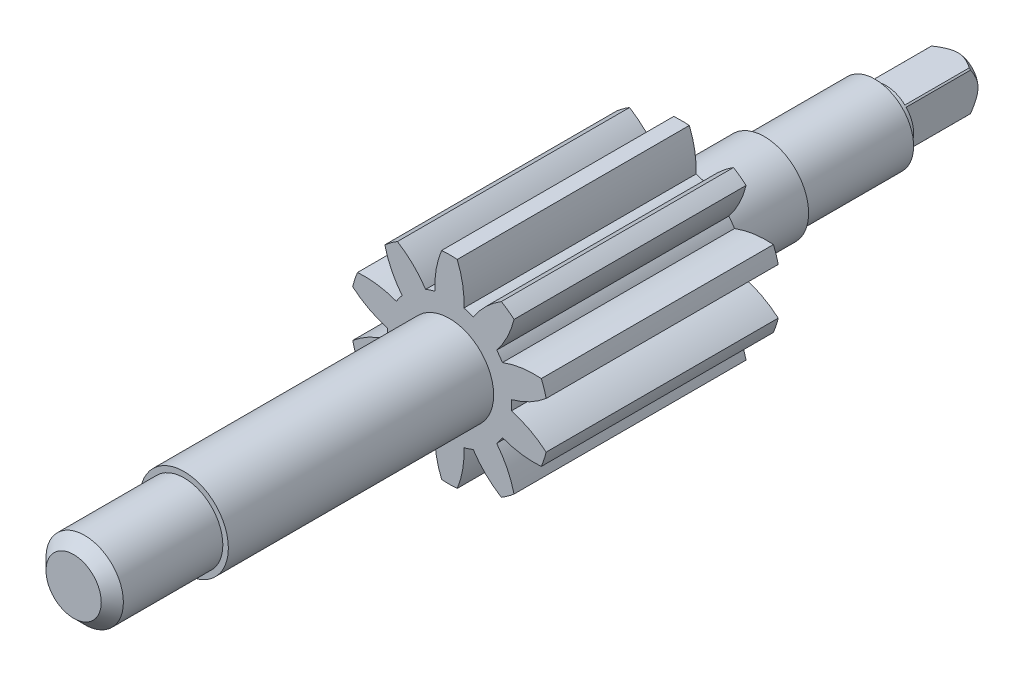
ISO-10303-21;
HEADER;
FILE_DESCRIPTION(('STEP AP214'),'2;1');
FILE_NAME('part.step','',(''),(''),'','','');
FILE_SCHEMA(('AUTOMOTIVE_DESIGN { 1 0 10303 214 1 1 1 1 }'));
ENDSEC;
DATA;
#1=APPLICATION_CONTEXT('core data for automotive mechanical design processes');
#2=APPLICATION_PROTOCOL_DEFINITION('international standard','automotive_design',2000,#1);
#3=PRODUCT_CONTEXT('',#1,'mechanical');
#4=PRODUCT('Part','Part','',(#3));
#5=PRODUCT_RELATED_PRODUCT_CATEGORY('part','',(#4));
#6=PRODUCT_DEFINITION_FORMATION('','',#4);
#7=PRODUCT_DEFINITION_CONTEXT('part definition',#1,'design');
#8=PRODUCT_DEFINITION('design','',#6,#7);
#9=PRODUCT_DEFINITION_SHAPE('','',#8);
#10=(LENGTH_UNIT() NAMED_UNIT(*) SI_UNIT(.MILLI.,.METRE.));
#11=(NAMED_UNIT(*) PLANE_ANGLE_UNIT() SI_UNIT($,.RADIAN.));
#12=(NAMED_UNIT(*) SI_UNIT($,.STERADIAN.) SOLID_ANGLE_UNIT());
#13=UNCERTAINTY_MEASURE_WITH_UNIT(LENGTH_MEASURE(1.E-05),#10,'distance_accuracy_value','');
#14=(GEOMETRIC_REPRESENTATION_CONTEXT(3) GLOBAL_UNCERTAINTY_ASSIGNED_CONTEXT((#13)) GLOBAL_UNIT_ASSIGNED_CONTEXT((#10,
#11,#12)) REPRESENTATION_CONTEXT('',''));
#15=CARTESIAN_POINT('',(0.,0.,0.));
#16=DIRECTION('',(0.,0.,1.));
#17=DIRECTION('',(1.,0.,0.));
#18=AXIS2_PLACEMENT_3D('',#15,#16,#17);
#19=CARTESIAN_POINT('',(0.,0.,-7.5));
#20=DIRECTION('',(0.,0.,-1.));
#21=DIRECTION('',(0.,1.,0.));
#22=AXIS2_PLACEMENT_3D('',#19,#20,#21);
#23=CYLINDRICAL_SURFACE('',#22,8.);
#24=CARTESIAN_POINT('',(0.,0.,0.));
#25=DIRECTION('',(0.,0.,1.));
#26=DIRECTION('',(0.,1.,0.));
#27=AXIS2_PLACEMENT_3D('',#24,#25,#26);
#28=CIRCLE('',#27,8.);
#29=CARTESIAN_POINT('',(0.,8.,0.));
#30=VERTEX_POINT('',#29);
#31=EDGE_CURVE('E690',#30,#30,#28,.T.);
#32=ORIENTED_EDGE('',*,*,#31,.F.);
#33=EDGE_LOOP('',(#32));
#34=FACE_BOUND('',#33,.T.);
#35=CARTESIAN_POINT('',(0.,0.,-15.));
#36=DIRECTION('',(0.,0.,-1.));
#37=DIRECTION('',(0.,1.,0.));
#38=AXIS2_PLACEMENT_3D('',#35,#36,#37);
#39=CIRCLE('',#38,8.);
#40=CARTESIAN_POINT('',(0.,8.,-15.));
#41=VERTEX_POINT('',#40);
#42=EDGE_CURVE('E383',#41,#41,#39,.T.);
#43=ORIENTED_EDGE('',*,*,#42,.F.);
#44=EDGE_LOOP('',(#43));
#45=FACE_BOUND('',#44,.T.);
#46=ADVANCED_FACE('F17',(#34,#45),#23,.T.);
#47=CARTESIAN_POINT('',(0.,7.5,-15.));
#48=DIRECTION('',(0.,0.,-1.));
#49=DIRECTION('',(0.,-1.,0.));
#50=AXIS2_PLACEMENT_3D('',#47,#48,#49);
#51=PLANE('',#50);
#52=CARTESIAN_POINT('',(0.,0.,-15.));
#53=DIRECTION('',(0.,0.,-1.));
#54=DIRECTION('',(0.,1.,0.));
#55=AXIS2_PLACEMENT_3D('',#52,#53,#54);
#56=CIRCLE('',#55,7.);
#57=CARTESIAN_POINT('',(0.,7.,-15.));
#58=VERTEX_POINT('',#57);
#59=EDGE_CURVE('E1132',#58,#58,#56,.T.);
#60=ORIENTED_EDGE('',*,*,#59,.F.);
#61=EDGE_LOOP('',(#60));
#62=FACE_BOUND('',#61,.T.);
#63=ORIENTED_EDGE('',*,*,#42,.T.);
#64=EDGE_LOOP('',(#63));
#65=FACE_BOUND('',#64,.T.);
#66=ADVANCED_FACE('F1296',(#62,#65),#51,.T.);
#67=CARTESIAN_POINT('',(0.,0.,-25.));
#68=DIRECTION('',(0.,0.,-1.));
#69=DIRECTION('',(0.,1.,0.));
#70=AXIS2_PLACEMENT_3D('',#67,#68,#69);
#71=CYLINDRICAL_SURFACE('',#70,7.);
#72=ORIENTED_EDGE('',*,*,#59,.T.);
#73=EDGE_LOOP('',(#72));
#74=FACE_BOUND('',#73,.T.);
#75=CARTESIAN_POINT('',(0.,0.,-35.));
#76=DIRECTION('',(0.,0.,-1.));
#77=DIRECTION('',(0.,1.,0.));
#78=AXIS2_PLACEMENT_3D('',#75,#76,#77);
#79=CIRCLE('',#78,7.);
#80=CARTESIAN_POINT('',(0.,7.,-35.));
#81=VERTEX_POINT('',#80);
#82=EDGE_CURVE('E1109',#81,#81,#79,.T.);
#83=ORIENTED_EDGE('',*,*,#82,.F.);
#84=EDGE_LOOP('',(#83));
#85=FACE_BOUND('',#84,.T.);
#86=ADVANCED_FACE('F1191',(#74,#85),#71,.T.);
#87=CARTESIAN_POINT('',(0.,6.,-35.));
#88=DIRECTION('',(0.,0.,-1.));
#89=DIRECTION('',(0.,-1.,0.));
#90=AXIS2_PLACEMENT_3D('',#87,#88,#89);
#91=PLANE('',#90);
#92=CARTESIAN_POINT('',(0.,0.,-35.));
#93=DIRECTION('',(0.,0.,-1.));
#94=DIRECTION('',(0.,1.,0.));
#95=AXIS2_PLACEMENT_3D('',#92,#93,#94);
#96=CIRCLE('',#95,5.);
#97=CARTESIAN_POINT('',(0.,5.,-35.));
#98=VERTEX_POINT('',#97);
#99=EDGE_CURVE('E643',#98,#98,#96,.T.);
#100=ORIENTED_EDGE('',*,*,#99,.F.);
#101=EDGE_LOOP('',(#100));
#102=FACE_BOUND('',#101,.T.);
#103=ORIENTED_EDGE('',*,*,#82,.T.);
#104=EDGE_LOOP('',(#103));
#105=FACE_BOUND('',#104,.T.);
#106=ADVANCED_FACE('F1187',(#102,#105),#91,.T.);
#107=CARTESIAN_POINT('',(0.,0.,0.));
#108=DIRECTION('',(0.,0.,1.));
#109=DIRECTION('',(-0.852640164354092,0.522498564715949,0.));
#110=AXIS2_PLACEMENT_3D('',#107,#108,#109);
#111=CYLINDRICAL_SURFACE('',#110,11.25);
#112=CARTESIAN_POINT('',(0.,0.,42.));
#113=DIRECTION('',(0.,0.,1.));
#114=DIRECTION('',(-0.852640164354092,0.522498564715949,0.));
#115=AXIS2_PLACEMENT_3D('',#112,#113,#114);
#116=CIRCLE('',#115,11.25);
#117=CARTESIAN_POINT('',(-8.55456711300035,7.30629054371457,42.));
#118=VERTEX_POINT('',#117);
#119=CARTESIAN_POINT('',(-9.59220184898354,5.87810885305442,42.));
#120=VERTEX_POINT('',#119);
#121=EDGE_CURVE('E890',#118,#120,#116,.T.);
#122=ORIENTED_EDGE('',*,*,#121,.F.);
#123=DIRECTION('',(0.,0.,1.));
#124=VECTOR('',#123,1.);
#125=CARTESIAN_POINT('',(-8.55456711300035,7.30629054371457,0.));
#126=LINE('',#125,#124);
#127=CARTESIAN_POINT('',(-8.55456711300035,7.30629054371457,0.));
#128=VERTEX_POINT('',#127);
#129=EDGE_CURVE('E1110',#128,#118,#126,.T.);
#130=ORIENTED_EDGE('',*,*,#129,.F.);
#131=CARTESIAN_POINT('',(0.,0.,0.));
#132=DIRECTION('',(0.,0.,-1.));
#133=DIRECTION('',(-0.852640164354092,0.522498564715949,0.));
#134=AXIS2_PLACEMENT_3D('',#131,#132,#133);
#135=CIRCLE('',#134,11.25);
#136=CARTESIAN_POINT('',(-9.59220184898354,5.87810885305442,0.));
#137=VERTEX_POINT('',#136);
#138=EDGE_CURVE('E694',#137,#128,#135,.T.);
#139=ORIENTED_EDGE('',*,*,#138,.F.);
#140=DIRECTION('',(0.,0.,1.));
#141=VECTOR('',#140,1.);
#142=CARTESIAN_POINT('',(-9.59220184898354,5.87810885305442,0.));
#143=LINE('',#142,#141);
#144=EDGE_CURVE('E1106',#137,#120,#143,.T.);
#145=ORIENTED_EDGE('',*,*,#144,.T.);
#146=EDGE_LOOP('',(#122,#130,#139,#145));
#147=FACE_BOUND('',#146,.T.);
#148=ADVANCED_FACE('F1190',(#147),#111,.T.);
#149=CARTESIAN_POINT('',(-15.3901718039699,-9.49480089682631,0.));
#150=DIRECTION('',(0.,0.,1.));
#151=DIRECTION('',(-0.075451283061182,0.997149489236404,0.));
#152=AXIS2_PLACEMENT_3D('',#149,#150,#151);
#153=CYLINDRICAL_SURFACE('',#152,16.4299363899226);
#154=CARTESIAN_POINT('',(-15.3901718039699,-9.49480089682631,42.));
#155=DIRECTION('',(0.,0.,1.));
#156=DIRECTION('',(-0.075451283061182,0.997149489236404,0.));
#157=AXIS2_PLACEMENT_3D('',#154,#155,#156);
#158=CIRCLE('',#157,16.4299363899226);
#159=CARTESIAN_POINT('',(-16.6298315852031,6.88830178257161,42.));
#160=VERTEX_POINT('',#159);
#161=EDGE_CURVE('E1021',#120,#160,#158,.T.);
#162=ORIENTED_EDGE('',*,*,#161,.F.);
#163=ORIENTED_EDGE('',*,*,#144,.F.);
#164=CARTESIAN_POINT('',(-15.3901718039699,-9.49480089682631,0.));
#165=DIRECTION('',(0.,0.,-1.));
#166=DIRECTION('',(-0.075451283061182,0.997149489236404,0.));
#167=AXIS2_PLACEMENT_3D('',#164,#165,#166);
#168=CIRCLE('',#167,16.4299363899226);
#169=CARTESIAN_POINT('',(-16.6298315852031,6.88830178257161,0.));
#170=VERTEX_POINT('',#169);
#171=EDGE_CURVE('E706',#170,#137,#168,.T.);
#172=ORIENTED_EDGE('',*,*,#171,.F.);
#173=DIRECTION('',(0.,0.,-1.));
#174=VECTOR('',#173,1.);
#175=CARTESIAN_POINT('',(-16.6298315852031,6.88830178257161,42.));
#176=LINE('',#175,#174);
#177=EDGE_CURVE('E974',#160,#170,#176,.T.);
#178=ORIENTED_EDGE('',*,*,#177,.F.);
#179=EDGE_LOOP('',(#162,#163,#172,#178));
#180=FACE_BOUND('',#179,.T.);
#181=ADVANCED_FACE('F1278',(#180),#153,.T.);
#182=CARTESIAN_POINT('',(4.27426763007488,17.5709780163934,0.));
#183=DIRECTION('',(0.,0.,1.));
#184=DIRECTION('',(-0.780820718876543,-0.624755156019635,0.));
#185=AXIS2_PLACEMENT_3D('',#182,#183,#184);
#186=CYLINDRICAL_SURFACE('',#185,16.4299363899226);
#187=CARTESIAN_POINT('',(4.27426763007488,17.5709780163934,42.));
#188=DIRECTION('',(0.,0.,1.));
#189=DIRECTION('',(-0.780820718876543,-0.624755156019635,0.));
#190=AXIS2_PLACEMENT_3D('',#187,#188,#189);
#191=CIRCLE('',#190,16.4299363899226);
#192=CARTESIAN_POINT('',(-11.6900648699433,13.6873073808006,42.));
#193=VERTEX_POINT('',#192);
#194=EDGE_CURVE('E886',#193,#118,#191,.T.);
#195=ORIENTED_EDGE('',*,*,#194,.F.);
#196=DIRECTION('',(0.,0.,1.));
#197=VECTOR('',#196,1.);
#198=CARTESIAN_POINT('',(-11.6900648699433,13.6873073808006,0.));
#199=LINE('',#198,#197);
#200=CARTESIAN_POINT('',(-11.6900648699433,13.6873073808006,0.));
#201=VERTEX_POINT('',#200);
#202=EDGE_CURVE('E693',#201,#193,#199,.T.);
#203=ORIENTED_EDGE('',*,*,#202,.F.);
#204=CARTESIAN_POINT('',(4.27426763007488,17.5709780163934,0.));
#205=DIRECTION('',(0.,0.,-1.));
#206=DIRECTION('',(-0.780820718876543,-0.624755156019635,0.));
#207=AXIS2_PLACEMENT_3D('',#204,#205,#206);
#208=CIRCLE('',#207,16.4299363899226);
#209=EDGE_CURVE('E778',#128,#201,#208,.T.);
#210=ORIENTED_EDGE('',*,*,#209,.F.);
#211=ORIENTED_EDGE('',*,*,#129,.T.);
#212=EDGE_LOOP('',(#195,#203,#210,#211));
#213=FACE_BOUND('',#212,.T.);
#214=ADVANCED_FACE('F1274',(#213),#186,.T.);
#215=CARTESIAN_POINT('',(0.,0.,0.));
#216=DIRECTION('',(0.,0.,1.));
#217=DIRECTION('',(-0.996917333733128,-0.078459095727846,0.));
#218=AXIS2_PLACEMENT_3D('',#215,#216,#217);
#219=CYLINDRICAL_SURFACE('',#218,11.25);
#220=CARTESIAN_POINT('',(0.,0.,42.));
#221=DIRECTION('',(0.,0.,1.));
#222=DIRECTION('',(-0.996917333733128,-0.078459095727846,0.));
#223=AXIS2_PLACEMENT_3D('',#220,#221,#222);
#224=CIRCLE('',#223,11.25);
#225=CARTESIAN_POINT('',(-11.2153200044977,0.882664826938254,42.));
#226=VERTEX_POINT('',#225);
#227=CARTESIAN_POINT('',(-11.2153200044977,-0.882664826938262,42.));
#228=VERTEX_POINT('',#227);
#229=EDGE_CURVE('E920',#226,#228,#224,.T.);
#230=ORIENTED_EDGE('',*,*,#229,.F.);
#231=DIRECTION('',(0.,0.,1.));
#232=VECTOR('',#231,1.);
#233=CARTESIAN_POINT('',(-11.2153200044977,0.882664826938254,0.));
#234=LINE('',#233,#232);
#235=CARTESIAN_POINT('',(-11.2153200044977,0.882664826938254,0.));
#236=VERTEX_POINT('',#235);
#237=EDGE_CURVE('E1122',#236,#226,#234,.T.);
#238=ORIENTED_EDGE('',*,*,#237,.F.);
#239=CARTESIAN_POINT('',(0.,0.,0.));
#240=DIRECTION('',(0.,0.,-1.));
#241=DIRECTION('',(-0.996917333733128,-0.078459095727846,0.));
#242=AXIS2_PLACEMENT_3D('',#239,#240,#241);
#243=CIRCLE('',#242,11.25);
#244=CARTESIAN_POINT('',(-11.2153200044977,-0.882664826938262,0.));
#245=VERTEX_POINT('',#244);
#246=EDGE_CURVE('E621',#245,#236,#243,.T.);
#247=ORIENTED_EDGE('',*,*,#246,.F.);
#248=DIRECTION('',(0.,0.,1.));
#249=VECTOR('',#248,1.);
#250=CARTESIAN_POINT('',(-11.2153200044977,-0.882664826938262,0.));
#251=LINE('',#250,#249);
#252=EDGE_CURVE('E1125',#245,#228,#251,.T.);
#253=ORIENTED_EDGE('',*,*,#252,.T.);
#254=EDGE_LOOP('',(#230,#238,#247,#253));
#255=FACE_BOUND('',#254,.T.);
#256=ADVANCED_FACE('F1277',(#255),#219,.T.);
#257=CARTESIAN_POINT('',(-6.87000659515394,-16.72757130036,0.));
#258=DIRECTION('',(0.,0.,1.));
#259=DIRECTION('',(-0.647151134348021,0.762361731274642,0.));
#260=AXIS2_PLACEMENT_3D('',#257,#258,#259);
#261=CYLINDRICAL_SURFACE('',#260,16.4299363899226);
#262=CARTESIAN_POINT('',(-6.87000659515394,-16.72757130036,42.));
#263=DIRECTION('',(0.,0.,1.));
#264=DIRECTION('',(-0.647151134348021,0.762361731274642,0.));
#265=AXIS2_PLACEMENT_3D('',#262,#263,#264);
#266=CIRCLE('',#265,16.4299363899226);
#267=CARTESIAN_POINT('',(-17.5026585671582,-4.20201654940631,42.));
#268=VERTEX_POINT('',#267);
#269=EDGE_CURVE('E917',#228,#268,#266,.T.);
#270=ORIENTED_EDGE('',*,*,#269,.F.);
#271=ORIENTED_EDGE('',*,*,#252,.F.);
#272=CARTESIAN_POINT('',(-6.87000659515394,-16.72757130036,0.));
#273=DIRECTION('',(0.,0.,-1.));
#274=DIRECTION('',(-0.647151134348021,0.762361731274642,0.));
#275=AXIS2_PLACEMENT_3D('',#272,#273,#274);
#276=CIRCLE('',#275,16.4299363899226);
#277=CARTESIAN_POINT('',(-17.5026585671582,-4.20201654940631,0.));
#278=VERTEX_POINT('',#277);
#279=EDGE_CURVE('E626',#278,#245,#276,.T.);
#280=ORIENTED_EDGE('',*,*,#279,.F.);
#281=DIRECTION('',(0.,0.,-1.));
#282=VECTOR('',#281,1.);
#283=CARTESIAN_POINT('',(-17.5026585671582,-4.20201654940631,42.));
#284=LINE('',#283,#282);
#285=EDGE_CURVE('E772',#268,#278,#284,.T.);
#286=ORIENTED_EDGE('',*,*,#285,.F.);
#287=EDGE_LOOP('',(#270,#271,#280,#286));
#288=FACE_BOUND('',#287,.T.);
#289=ADVANCED_FACE('F1282',(#288),#261,.T.);
#290=CARTESIAN_POINT('',(-6.87000659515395,16.72757130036,0.));
#291=DIRECTION('',(0.,0.,1.));
#292=DIRECTION('',(-0.264475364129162,-0.964392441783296,0.));
#293=AXIS2_PLACEMENT_3D('',#290,#291,#292);
#294=CYLINDRICAL_SURFACE('',#293,16.4299363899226);
#295=CARTESIAN_POINT('',(-6.87000659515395,16.72757130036,42.));
#296=DIRECTION('',(0.,0.,1.));
#297=DIRECTION('',(-0.264475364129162,-0.964392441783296,0.));
#298=AXIS2_PLACEMENT_3D('',#295,#296,#297);
#299=CIRCLE('',#298,16.4299363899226);
#300=CARTESIAN_POINT('',(-17.5026585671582,4.2020165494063,42.));
#301=VERTEX_POINT('',#300);
#302=EDGE_CURVE('E1024',#301,#226,#299,.T.);
#303=ORIENTED_EDGE('',*,*,#302,.F.);
#304=DIRECTION('',(0.,0.,1.));
#305=VECTOR('',#304,1.);
#306=CARTESIAN_POINT('',(-17.5026585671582,4.2020165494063,0.));
#307=LINE('',#306,#305);
#308=CARTESIAN_POINT('',(-17.5026585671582,4.2020165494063,0.));
#309=VERTEX_POINT('',#308);
#310=EDGE_CURVE('E833',#309,#301,#307,.T.);
#311=ORIENTED_EDGE('',*,*,#310,.F.);
#312=CARTESIAN_POINT('',(-6.87000659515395,16.72757130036,0.));
#313=DIRECTION('',(0.,0.,-1.));
#314=DIRECTION('',(-0.264475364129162,-0.964392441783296,0.));
#315=AXIS2_PLACEMENT_3D('',#312,#313,#314);
#316=CIRCLE('',#315,16.4299363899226);
#317=EDGE_CURVE('E625',#236,#309,#316,.T.);
#318=ORIENTED_EDGE('',*,*,#317,.F.);
#319=ORIENTED_EDGE('',*,*,#237,.T.);
#320=EDGE_LOOP('',(#303,#311,#318,#319));
#321=FACE_BOUND('',#320,.T.);
#322=ADVANCED_FACE('F1272',(#321),#294,.T.);
#323=CARTESIAN_POINT('',(0.,0.,0.));
#324=DIRECTION('',(0.,0.,1.));
#325=DIRECTION('',(-0.760405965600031,-0.649448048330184,0.));
#326=AXIS2_PLACEMENT_3D('',#323,#324,#325);
#327=CYLINDRICAL_SURFACE('',#326,11.25);
#328=CARTESIAN_POINT('',(0.,0.,42.));
#329=DIRECTION('',(0.,0.,1.));
#330=DIRECTION('',(-0.760405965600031,-0.649448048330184,0.));
#331=AXIS2_PLACEMENT_3D('',#328,#329,#330);
#332=CIRCLE('',#331,11.25);
#333=CARTESIAN_POINT('',(-9.59220184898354,-5.87810885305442,42.));
#334=VERTEX_POINT('',#333);
#335=CARTESIAN_POINT('',(-8.55456711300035,-7.30629054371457,42.));
#336=VERTEX_POINT('',#335);
#337=EDGE_CURVE('E725',#334,#336,#332,.T.);
#338=ORIENTED_EDGE('',*,*,#337,.F.);
#339=DIRECTION('',(0.,0.,1.));
#340=VECTOR('',#339,1.);
#341=CARTESIAN_POINT('',(-9.59220184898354,-5.87810885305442,0.));
#342=LINE('',#341,#340);
#343=CARTESIAN_POINT('',(-9.59220184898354,-5.87810885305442,0.));
#344=VERTEX_POINT('',#343);
#345=EDGE_CURVE('E1116',#344,#334,#342,.T.);
#346=ORIENTED_EDGE('',*,*,#345,.F.);
#347=CARTESIAN_POINT('',(0.,0.,0.));
#348=DIRECTION('',(0.,0.,-1.));
#349=DIRECTION('',(-0.760405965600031,-0.649448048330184,0.));
#350=AXIS2_PLACEMENT_3D('',#347,#348,#349);
#351=CIRCLE('',#350,11.25);
#352=CARTESIAN_POINT('',(-8.55456711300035,-7.30629054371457,0.));
#353=VERTEX_POINT('',#352);
#354=EDGE_CURVE('E660',#353,#344,#351,.T.);
#355=ORIENTED_EDGE('',*,*,#354,.F.);
#356=DIRECTION('',(0.,0.,1.));
#357=VECTOR('',#356,1.);
#358=CARTESIAN_POINT('',(-8.55456711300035,-7.30629054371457,0.));
#359=LINE('',#358,#357);
#360=EDGE_CURVE('E1119',#353,#336,#359,.T.);
#361=ORIENTED_EDGE('',*,*,#360,.T.);
#362=EDGE_LOOP('',(#338,#346,#355,#361));
#363=FACE_BOUND('',#362,.T.);
#364=ADVANCED_FACE('F1268',(#363),#327,.T.);
#365=CARTESIAN_POINT('',(4.27426763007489,-17.5709780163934,0.));
#366=DIRECTION('',(0.,0.,1.));
#367=DIRECTION('',(-0.971661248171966,0.23637770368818,0.));
#368=AXIS2_PLACEMENT_3D('',#365,#366,#367);
#369=CYLINDRICAL_SURFACE('',#368,16.4299363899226);
#370=CARTESIAN_POINT('',(4.27426763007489,-17.5709780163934,42.));
#371=DIRECTION('',(0.,0.,1.));
#372=DIRECTION('',(-0.971661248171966,0.23637770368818,0.));
#373=AXIS2_PLACEMENT_3D('',#370,#371,#372);
#374=CIRCLE('',#373,16.4299363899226);
#375=CARTESIAN_POINT('',(-11.6900648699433,-13.6873073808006,42.));
#376=VERTEX_POINT('',#375);
#377=EDGE_CURVE('E732',#336,#376,#374,.T.);
#378=ORIENTED_EDGE('',*,*,#377,.F.);
#379=ORIENTED_EDGE('',*,*,#360,.F.);
#380=CARTESIAN_POINT('',(4.27426763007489,-17.5709780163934,0.));
#381=DIRECTION('',(0.,0.,-1.));
#382=DIRECTION('',(-0.971661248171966,0.23637770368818,0.));
#383=AXIS2_PLACEMENT_3D('',#380,#381,#382);
#384=CIRCLE('',#383,16.4299363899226);
#385=CARTESIAN_POINT('',(-11.6900648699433,-13.6873073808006,0.));
#386=VERTEX_POINT('',#385);
#387=EDGE_CURVE('E594',#386,#353,#384,.T.);
#388=ORIENTED_EDGE('',*,*,#387,.F.);
#389=DIRECTION('',(0.,0.,-1.));
#390=VECTOR('',#389,1.);
#391=CARTESIAN_POINT('',(-11.6900648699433,-13.6873073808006,42.));
#392=LINE('',#391,#390);
#393=EDGE_CURVE('E841',#376,#386,#392,.T.);
#394=ORIENTED_EDGE('',*,*,#393,.F.);
#395=EDGE_LOOP('',(#378,#379,#388,#394));
#396=FACE_BOUND('',#395,.T.);
#397=ADVANCED_FACE('F1264',(#396),#369,.T.);
#398=CARTESIAN_POINT('',(-15.3901718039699,9.4948008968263,0.));
#399=DIRECTION('',(0.,0.,1.));
#400=DIRECTION('',(0.352890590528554,-0.935664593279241,0.));
#401=AXIS2_PLACEMENT_3D('',#398,#399,#400);
#402=CYLINDRICAL_SURFACE('',#401,16.4299363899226);
#403=CARTESIAN_POINT('',(-15.3901718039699,9.4948008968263,42.));
#404=DIRECTION('',(0.,0.,1.));
#405=DIRECTION('',(0.352890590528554,-0.935664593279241,0.));
#406=AXIS2_PLACEMENT_3D('',#403,#404,#405);
#407=CIRCLE('',#406,16.4299363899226);
#408=CARTESIAN_POINT('',(-16.6298315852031,-6.88830178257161,42.));
#409=VERTEX_POINT('',#408);
#410=EDGE_CURVE('E733',#409,#334,#407,.T.);
#411=ORIENTED_EDGE('',*,*,#410,.F.);
#412=DIRECTION('',(0.,0.,1.));
#413=VECTOR('',#412,1.);
#414=CARTESIAN_POINT('',(-16.6298315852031,-6.88830178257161,0.));
#415=LINE('',#414,#413);
#416=CARTESIAN_POINT('',(-16.6298315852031,-6.88830178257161,0.));
#417=VERTEX_POINT('',#416);
#418=EDGE_CURVE('E767',#417,#409,#415,.T.);
#419=ORIENTED_EDGE('',*,*,#418,.F.);
#420=CARTESIAN_POINT('',(-15.3901718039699,9.4948008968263,0.));
#421=DIRECTION('',(0.,0.,-1.));
#422=DIRECTION('',(0.352890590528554,-0.935664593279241,0.));
#423=AXIS2_PLACEMENT_3D('',#420,#421,#422);
#424=CIRCLE('',#423,16.4299363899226);
#425=EDGE_CURVE('E664',#344,#417,#424,.T.);
#426=ORIENTED_EDGE('',*,*,#425,.F.);
#427=ORIENTED_EDGE('',*,*,#345,.T.);
#428=EDGE_LOOP('',(#411,#419,#426,#427));
#429=FACE_BOUND('',#428,.T.);
#430=ADVANCED_FACE('F1260',(#429),#402,.T.);
#431=CARTESIAN_POINT('',(0.,0.,0.));
#432=DIRECTION('',(0.,0.,1.));
#433=DIRECTION('',(-0.233445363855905,-0.972369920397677,0.));
#434=AXIS2_PLACEMENT_3D('',#431,#432,#433);
#435=CYLINDRICAL_SURFACE('',#434,11.25);
#436=CARTESIAN_POINT('',(0.,0.,42.));
#437=DIRECTION('',(0.,0.,1.));
#438=DIRECTION('',(-0.233445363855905,-0.972369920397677,0.));
#439=AXIS2_PLACEMENT_3D('',#436,#437,#438);
#440=CIRCLE('',#439,11.25);
#441=CARTESIAN_POINT('',(-4.30518861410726,-10.393644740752,42.));
#442=VERTEX_POINT('',#441);
#443=CARTESIAN_POINT('',(-2.62626034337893,-10.9391616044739,42.));
#444=VERTEX_POINT('',#443);
#445=EDGE_CURVE('E1031',#442,#444,#440,.T.);
#446=ORIENTED_EDGE('',*,*,#445,.F.);
#447=DIRECTION('',(0.,0.,1.));
#448=VECTOR('',#447,1.);
#449=CARTESIAN_POINT('',(-4.30518861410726,-10.393644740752,0.));
#450=LINE('',#449,#448);
#451=CARTESIAN_POINT('',(-4.30518861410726,-10.393644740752,0.));
#452=VERTEX_POINT('',#451);
#453=EDGE_CURVE('E1105',#452,#442,#450,.T.);
#454=ORIENTED_EDGE('',*,*,#453,.F.);
#455=CARTESIAN_POINT('',(0.,0.,0.));
#456=DIRECTION('',(0.,0.,-1.));
#457=DIRECTION('',(-0.233445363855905,-0.972369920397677,0.));
#458=AXIS2_PLACEMENT_3D('',#455,#456,#457);
#459=CIRCLE('',#458,11.25);
#460=CARTESIAN_POINT('',(-2.62626034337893,-10.9391616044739,0.));
#461=VERTEX_POINT('',#460);
#462=EDGE_CURVE('E539',#461,#452,#459,.T.);
#463=ORIENTED_EDGE('',*,*,#462,.F.);
#464=DIRECTION('',(0.,0.,1.));
#465=VECTOR('',#464,1.);
#466=CARTESIAN_POINT('',(-2.62626034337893,-10.9391616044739,0.));
#467=LINE('',#466,#465);
#468=EDGE_CURVE('E1113',#461,#444,#467,.T.);
#469=ORIENTED_EDGE('',*,*,#468,.T.);
#470=EDGE_LOOP('',(#446,#454,#463,#469));
#471=FACE_BOUND('',#470,.T.);
#472=ADVANCED_FACE('F1256',(#471),#435,.T.);
#473=CARTESIAN_POINT('',(13.7859168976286,-11.7028683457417,0.));
#474=DIRECTION('',(0.,0.,1.));
#475=DIRECTION('',(-0.925029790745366,-0.379894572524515,0.));
#476=AXIS2_PLACEMENT_3D('',#473,#474,#475);
#477=CYLINDRICAL_SURFACE('',#476,16.4299363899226);
#478=CARTESIAN_POINT('',(13.7859168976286,-11.7028683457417,42.));
#479=DIRECTION('',(0.,0.,1.));
#480=DIRECTION('',(-0.925029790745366,-0.379894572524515,0.));
#481=AXIS2_PLACEMENT_3D('',#478,#479,#480);
#482=CIRCLE('',#481,16.4299363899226);
#483=CARTESIAN_POINT('',(-1.4122637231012,-17.9445120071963,42.));
#484=VERTEX_POINT('',#483);
#485=EDGE_CURVE('E900',#444,#484,#482,.T.);
#486=ORIENTED_EDGE('',*,*,#485,.F.);
#487=ORIENTED_EDGE('',*,*,#468,.F.);
#488=CARTESIAN_POINT('',(13.7859168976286,-11.7028683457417,0.));
#489=DIRECTION('',(0.,0.,-1.));
#490=DIRECTION('',(-0.925029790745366,-0.379894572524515,0.));
#491=AXIS2_PLACEMENT_3D('',#488,#489,#490);
#492=CIRCLE('',#491,16.4299363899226);
#493=CARTESIAN_POINT('',(-1.4122637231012,-17.9445120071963,0.));
#494=VERTEX_POINT('',#493);
#495=EDGE_CURVE('E793',#494,#461,#492,.T.);
#496=ORIENTED_EDGE('',*,*,#495,.F.);
#497=DIRECTION('',(0.,0.,-1.));
#498=VECTOR('',#497,1.);
#499=CARTESIAN_POINT('',(-1.4122637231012,-17.9445120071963,42.));
#500=LINE('',#499,#498);
#501=EDGE_CURVE('E586',#484,#494,#500,.T.);
#502=ORIENTED_EDGE('',*,*,#501,.F.);
#503=EDGE_LOOP('',(#486,#487,#496,#502));
#504=FACE_BOUND('',#503,.T.);
#505=ADVANCED_FACE('F1252',(#504),#477,.T.);
#506=CARTESIAN_POINT('',(-18.0318144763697,-1.36466073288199,0.));
#507=DIRECTION('',(0.,0.,1.));
#508=DIRECTION('',(0.835464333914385,-0.549544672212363,0.));
#509=AXIS2_PLACEMENT_3D('',#506,#507,#508);
#510=CYLINDRICAL_SURFACE('',#509,16.4299363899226);
#511=CARTESIAN_POINT('',(-18.0318144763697,-1.36466073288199,42.));
#512=DIRECTION('',(0.,0.,1.));
#513=DIRECTION('',(0.835464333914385,-0.549544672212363,0.));
#514=AXIS2_PLACEMENT_3D('',#511,#512,#513);
#515=CIRCLE('',#514,16.4299363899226);
#516=CARTESIAN_POINT('',(-9.40497416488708,-15.3475229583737,42.));
#517=VERTEX_POINT('',#516);
#518=EDGE_CURVE('E903',#517,#442,#515,.T.);
#519=ORIENTED_EDGE('',*,*,#518,.F.);
#520=DIRECTION('',(0.,0.,1.));
#521=VECTOR('',#520,1.);
#522=CARTESIAN_POINT('',(-9.40497416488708,-15.3475229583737,0.));
#523=LINE('',#522,#521);
#524=CARTESIAN_POINT('',(-9.40497416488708,-15.3475229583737,0.));
#525=VERTEX_POINT('',#524);
#526=EDGE_CURVE('E929',#525,#517,#523,.T.);
#527=ORIENTED_EDGE('',*,*,#526,.F.);
#528=CARTESIAN_POINT('',(-18.0318144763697,-1.36466073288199,0.));
#529=DIRECTION('',(0.,0.,-1.));
#530=DIRECTION('',(0.835464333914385,-0.549544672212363,0.));
#531=AXIS2_PLACEMENT_3D('',#528,#529,#530);
#532=CIRCLE('',#531,16.4299363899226);
#533=EDGE_CURVE('E534',#452,#525,#532,.T.);
#534=ORIENTED_EDGE('',*,*,#533,.F.);
#535=ORIENTED_EDGE('',*,*,#453,.T.);
#536=EDGE_LOOP('',(#519,#527,#534,#535));
#537=FACE_BOUND('',#536,.T.);
#538=ADVANCED_FACE('F1248',(#537),#510,.T.);
#539=CARTESIAN_POINT('',(0.,0.,0.));
#540=DIRECTION('',(0.,0.,1.));
#541=DIRECTION('',(0.38268343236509,-0.923879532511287,0.));
#542=AXIS2_PLACEMENT_3D('',#539,#540,#541);
#543=CYLINDRICAL_SURFACE('',#542,11.25);
#544=CARTESIAN_POINT('',(0.,0.,42.));
#545=DIRECTION('',(0.,0.,1.));
#546=DIRECTION('',(0.38268343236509,-0.923879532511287,0.));
#547=AXIS2_PLACEMENT_3D('',#544,#545,#546);
#548=CIRCLE('',#547,11.25);
#549=CARTESIAN_POINT('',(2.62626034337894,-10.9391616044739,42.));
#550=VERTEX_POINT('',#549);
#551=CARTESIAN_POINT('',(4.30518861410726,-10.393644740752,42.));
#552=VERTEX_POINT('',#551);
#553=EDGE_CURVE('E899',#550,#552,#548,.T.);
#554=ORIENTED_EDGE('',*,*,#553,.F.);
#555=DIRECTION('',(0.,0.,1.));
#556=VECTOR('',#555,1.);
#557=CARTESIAN_POINT('',(2.62626034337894,-10.9391616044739,0.));
#558=LINE('',#557,#556);
#559=CARTESIAN_POINT('',(2.62626034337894,-10.9391616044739,0.));
#560=VERTEX_POINT('',#559);
#561=EDGE_CURVE('E1099',#560,#550,#558,.T.);
#562=ORIENTED_EDGE('',*,*,#561,.F.);
#563=CARTESIAN_POINT('',(0.,0.,0.));
#564=DIRECTION('',(0.,0.,-1.));
#565=DIRECTION('',(0.38268343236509,-0.923879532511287,0.));
#566=AXIS2_PLACEMENT_3D('',#563,#564,#565);
#567=CIRCLE('',#566,11.25);
#568=CARTESIAN_POINT('',(4.30518861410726,-10.393644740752,0.));
#569=VERTEX_POINT('',#568);
#570=EDGE_CURVE('E871',#569,#560,#567,.T.);
#571=ORIENTED_EDGE('',*,*,#570,.F.);
#572=DIRECTION('',(0.,0.,1.));
#573=VECTOR('',#572,1.);
#574=CARTESIAN_POINT('',(4.30518861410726,-10.393644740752,0.));
#575=LINE('',#574,#573);
#576=EDGE_CURVE('E1102',#569,#552,#575,.T.);
#577=ORIENTED_EDGE('',*,*,#576,.T.);
#578=EDGE_LOOP('',(#554,#562,#571,#577));
#579=FACE_BOUND('',#578,.T.);
#580=ADVANCED_FACE('F1244',(#579),#543,.T.);
#581=CARTESIAN_POINT('',(18.0318144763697,-1.36466073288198,0.));
#582=DIRECTION('',(0.,0.,1.));
#583=DIRECTION('',(-0.52506839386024,-0.851060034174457,0.));
#584=AXIS2_PLACEMENT_3D('',#581,#582,#583);
#585=CYLINDRICAL_SURFACE('',#584,16.4299363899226);
#586=CARTESIAN_POINT('',(18.0318144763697,-1.36466073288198,42.));
#587=DIRECTION('',(0.,0.,1.));
#588=DIRECTION('',(-0.52506839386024,-0.851060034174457,0.));
#589=AXIS2_PLACEMENT_3D('',#586,#587,#588);
#590=CIRCLE('',#589,16.4299363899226);
#591=CARTESIAN_POINT('',(9.40497416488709,-15.3475229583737,42.));
#592=VERTEX_POINT('',#591);
#593=EDGE_CURVE('E1006',#552,#592,#590,.T.);
#594=ORIENTED_EDGE('',*,*,#593,.F.);
#595=ORIENTED_EDGE('',*,*,#576,.F.);
#596=CARTESIAN_POINT('',(18.0318144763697,-1.36466073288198,0.));
#597=DIRECTION('',(0.,0.,-1.));
#598=DIRECTION('',(-0.52506839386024,-0.851060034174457,0.));
#599=AXIS2_PLACEMENT_3D('',#596,#597,#598);
#600=CIRCLE('',#599,16.4299363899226);
#601=CARTESIAN_POINT('',(9.40497416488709,-15.3475229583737,0.));
#602=VERTEX_POINT('',#601);
#603=EDGE_CURVE('E571',#602,#569,#600,.T.);
#604=ORIENTED_EDGE('',*,*,#603,.F.);
#605=DIRECTION('',(0.,0.,-1.));
#606=VECTOR('',#605,1.);
#607=CARTESIAN_POINT('',(9.40497416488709,-15.3475229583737,42.));
#608=LINE('',#607,#606);
#609=EDGE_CURVE('E702',#592,#602,#608,.T.);
#610=ORIENTED_EDGE('',*,*,#609,.F.);
#611=EDGE_LOOP('',(#594,#595,#604,#610));
#612=FACE_BOUND('',#611,.T.);
#613=ADVANCED_FACE('F1241',(#612),#585,.T.);
#614=CARTESIAN_POINT('',(-13.7859168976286,-11.7028683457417,0.));
#615=DIRECTION('',(0.,0.,1.));
#616=DIRECTION('',(0.998919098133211,0.046482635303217,0.));
#617=AXIS2_PLACEMENT_3D('',#614,#615,#616);
#618=CYLINDRICAL_SURFACE('',#617,16.4299363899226);
#619=CARTESIAN_POINT('',(-13.7859168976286,-11.7028683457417,42.));
#620=DIRECTION('',(0.,0.,1.));
#621=DIRECTION('',(0.998919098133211,0.046482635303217,0.));
#622=AXIS2_PLACEMENT_3D('',#619,#620,#621);
#623=CIRCLE('',#622,16.4299363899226);
#624=CARTESIAN_POINT('',(1.41226372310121,-17.9445120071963,42.));
#625=VERTEX_POINT('',#624);
#626=EDGE_CURVE('E895',#625,#550,#623,.T.);
#627=ORIENTED_EDGE('',*,*,#626,.F.);
#628=DIRECTION('',(0.,0.,1.));
#629=VECTOR('',#628,1.);
#630=CARTESIAN_POINT('',(1.41226372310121,-17.9445120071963,0.));
#631=LINE('',#630,#629);
#632=CARTESIAN_POINT('',(1.41226372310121,-17.9445120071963,0.));
#633=VERTEX_POINT('',#632);
#634=EDGE_CURVE('E589',#633,#625,#631,.T.);
#635=ORIENTED_EDGE('',*,*,#634,.F.);
#636=CARTESIAN_POINT('',(-13.7859168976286,-11.7028683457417,0.));
#637=DIRECTION('',(0.,0.,-1.));
#638=DIRECTION('',(0.998919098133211,0.046482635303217,0.));
#639=AXIS2_PLACEMENT_3D('',#636,#637,#638);
#640=CIRCLE('',#639,16.4299363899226);
#641=EDGE_CURVE('E794',#560,#633,#640,.T.);
#642=ORIENTED_EDGE('',*,*,#641,.F.);
#643=ORIENTED_EDGE('',*,*,#561,.T.);
#644=EDGE_LOOP('',(#627,#635,#642,#643));
#645=FACE_BOUND('',#644,.T.);
#646=ADVANCED_FACE('F1215',(#645),#618,.T.);
#647=CARTESIAN_POINT('',(0.,0.,0.));
#648=DIRECTION('',(0.,0.,1.));
#649=DIRECTION('',(0.852640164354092,-0.522498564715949,0.));
#650=AXIS2_PLACEMENT_3D('',#647,#648,#649);
#651=CYLINDRICAL_SURFACE('',#650,11.25);
#652=CARTESIAN_POINT('',(0.,0.,42.));
#653=DIRECTION('',(0.,0.,1.));
#654=DIRECTION('',(0.852640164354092,-0.522498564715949,0.));
#655=AXIS2_PLACEMENT_3D('',#652,#653,#654);
#656=CIRCLE('',#655,11.25);
#657=CARTESIAN_POINT('',(8.55456711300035,-7.30629054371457,42.));
#658=VERTEX_POINT('',#657);
#659=CARTESIAN_POINT('',(9.59220184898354,-5.87810885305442,42.));
#660=VERTEX_POINT('',#659);
#661=EDGE_CURVE('E528',#658,#660,#656,.T.);
#662=ORIENTED_EDGE('',*,*,#661,.F.);
#663=DIRECTION('',(0.,0.,1.));
#664=VECTOR('',#663,1.);
#665=CARTESIAN_POINT('',(8.55456711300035,-7.30629054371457,0.));
#666=LINE('',#665,#664);
#667=CARTESIAN_POINT('',(8.55456711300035,-7.30629054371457,0.));
#668=VERTEX_POINT('',#667);
#669=EDGE_CURVE('E921',#668,#658,#666,.T.);
#670=ORIENTED_EDGE('',*,*,#669,.F.);
#671=CARTESIAN_POINT('',(0.,0.,0.));
#672=DIRECTION('',(0.,0.,-1.));
#673=DIRECTION('',(0.852640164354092,-0.522498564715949,0.));
#674=AXIS2_PLACEMENT_3D('',#671,#672,#673);
#675=CIRCLE('',#674,11.25);
#676=CARTESIAN_POINT('',(9.59220184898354,-5.87810885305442,0.));
#677=VERTEX_POINT('',#676);
#678=EDGE_CURVE('E710',#677,#668,#675,.T.);
#679=ORIENTED_EDGE('',*,*,#678,.F.);
#680=DIRECTION('',(0.,0.,1.));
#681=VECTOR('',#680,1.);
#682=CARTESIAN_POINT('',(9.59220184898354,-5.87810885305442,0.));
#683=LINE('',#682,#681);
#684=EDGE_CURVE('E924',#677,#660,#683,.T.);
#685=ORIENTED_EDGE('',*,*,#684,.T.);
#686=EDGE_LOOP('',(#662,#670,#679,#685));
#687=FACE_BOUND('',#686,.T.);
#688=ADVANCED_FACE('F1211',(#687),#651,.T.);
#689=CARTESIAN_POINT('',(15.3901718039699,9.49480089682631,0.));
#690=DIRECTION('',(0.,0.,1.));
#691=DIRECTION('',(0.075451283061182,-0.997149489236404,0.));
#692=AXIS2_PLACEMENT_3D('',#689,#690,#691);
#693=CYLINDRICAL_SURFACE('',#692,16.4299363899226);
#694=CARTESIAN_POINT('',(15.3901718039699,9.49480089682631,42.));
#695=DIRECTION('',(0.,0.,1.));
#696=DIRECTION('',(0.075451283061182,-0.997149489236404,0.));
#697=AXIS2_PLACEMENT_3D('',#694,#695,#696);
#698=CIRCLE('',#697,16.4299363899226);
#699=CARTESIAN_POINT('',(16.6298315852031,-6.88830178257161,42.));
#700=VERTEX_POINT('',#699);
#701=EDGE_CURVE('E532',#660,#700,#698,.T.);
#702=ORIENTED_EDGE('',*,*,#701,.F.);
#703=ORIENTED_EDGE('',*,*,#684,.F.);
#704=CARTESIAN_POINT('',(15.3901718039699,9.49480089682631,0.));
#705=DIRECTION('',(0.,0.,-1.));
#706=DIRECTION('',(0.075451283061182,-0.997149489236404,0.));
#707=AXIS2_PLACEMENT_3D('',#704,#705,#706);
#708=CIRCLE('',#707,16.4299363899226);
#709=CARTESIAN_POINT('',(16.6298315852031,-6.88830178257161,0.));
#710=VERTEX_POINT('',#709);
#711=EDGE_CURVE('E810',#710,#677,#708,.T.);
#712=ORIENTED_EDGE('',*,*,#711,.F.);
#713=DIRECTION('',(0.,0.,-1.));
#714=VECTOR('',#713,1.);
#715=CARTESIAN_POINT('',(16.6298315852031,-6.88830178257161,42.));
#716=LINE('',#715,#714);
#717=EDGE_CURVE('E938',#700,#710,#716,.T.);
#718=ORIENTED_EDGE('',*,*,#717,.F.);
#719=EDGE_LOOP('',(#702,#703,#712,#718));
#720=FACE_BOUND('',#719,.T.);
#721=ADVANCED_FACE('F1214',(#720),#693,.T.);
#722=CARTESIAN_POINT('',(-4.27426763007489,-17.5709780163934,0.));
#723=DIRECTION('',(0.,0.,1.));
#724=DIRECTION('',(0.780820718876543,0.624755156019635,0.));
#725=AXIS2_PLACEMENT_3D('',#722,#723,#724);
#726=CYLINDRICAL_SURFACE('',#725,16.4299363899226);
#727=CARTESIAN_POINT('',(-4.27426763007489,-17.5709780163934,42.));
#728=DIRECTION('',(0.,0.,1.));
#729=DIRECTION('',(0.780820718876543,0.624755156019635,0.));
#730=AXIS2_PLACEMENT_3D('',#727,#728,#729);
#731=CIRCLE('',#730,16.4299363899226);
#732=CARTESIAN_POINT('',(11.6900648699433,-13.6873073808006,42.));
#733=VERTEX_POINT('',#732);
#734=EDGE_CURVE('E533',#733,#658,#731,.T.);
#735=ORIENTED_EDGE('',*,*,#734,.F.);
#736=DIRECTION('',(0.,0.,1.));
#737=VECTOR('',#736,1.);
#738=CARTESIAN_POINT('',(11.6900648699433,-13.6873073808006,0.));
#739=LINE('',#738,#737);
#740=CARTESIAN_POINT('',(11.6900648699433,-13.6873073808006,0.));
#741=VERTEX_POINT('',#740);
#742=EDGE_CURVE('E697',#741,#733,#739,.T.);
#743=ORIENTED_EDGE('',*,*,#742,.F.);
#744=CARTESIAN_POINT('',(-4.27426763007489,-17.5709780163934,0.));
#745=DIRECTION('',(0.,0.,-1.));
#746=DIRECTION('',(0.780820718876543,0.624755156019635,0.));
#747=AXIS2_PLACEMENT_3D('',#744,#745,#746);
#748=CIRCLE('',#747,16.4299363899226);
#749=EDGE_CURVE('E572',#668,#741,#748,.T.);
#750=ORIENTED_EDGE('',*,*,#749,.F.);
#751=ORIENTED_EDGE('',*,*,#669,.T.);
#752=EDGE_LOOP('',(#735,#743,#750,#751));
#753=FACE_BOUND('',#752,.T.);
#754=ADVANCED_FACE('F1236',(#753),#726,.T.);
#755=CARTESIAN_POINT('',(0.,0.,0.));
#756=DIRECTION('',(0.,0.,1.));
#757=DIRECTION('',(0.996917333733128,0.078459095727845,0.));
#758=AXIS2_PLACEMENT_3D('',#755,#756,#757);
#759=CYLINDRICAL_SURFACE('',#758,11.25);
#760=CARTESIAN_POINT('',(0.,0.,42.));
#761=DIRECTION('',(0.,0.,1.));
#762=DIRECTION('',(0.996917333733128,0.078459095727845,0.));
#763=AXIS2_PLACEMENT_3D('',#760,#761,#762);
#764=CIRCLE('',#763,11.25);
#765=CARTESIAN_POINT('',(11.2153200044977,-0.882664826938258,42.));
#766=VERTEX_POINT('',#765);
#767=CARTESIAN_POINT('',(11.2153200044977,0.882664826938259,42.));
#768=VERTEX_POINT('',#767);
#769=EDGE_CURVE('E1051',#766,#768,#764,.T.);
#770=ORIENTED_EDGE('',*,*,#769,.F.);
#771=DIRECTION('',(0.,0.,1.));
#772=VECTOR('',#771,1.);
#773=CARTESIAN_POINT('',(11.2153200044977,-0.882664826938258,0.));
#774=LINE('',#773,#772);
#775=CARTESIAN_POINT('',(11.2153200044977,-0.882664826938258,0.));
#776=VERTEX_POINT('',#775);
#777=EDGE_CURVE('E1092',#776,#766,#774,.T.);
#778=ORIENTED_EDGE('',*,*,#777,.F.);
#779=CARTESIAN_POINT('',(0.,0.,0.));
#780=DIRECTION('',(0.,0.,-1.));
#781=DIRECTION('',(0.996917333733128,0.078459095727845,0.));
#782=AXIS2_PLACEMENT_3D('',#779,#780,#781);
#783=CIRCLE('',#782,11.25);
#784=CARTESIAN_POINT('',(11.2153200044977,0.882664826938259,0.));
#785=VERTEX_POINT('',#784);
#786=EDGE_CURVE('E854',#785,#776,#783,.T.);
#787=ORIENTED_EDGE('',*,*,#786,.F.);
#788=DIRECTION('',(0.,0.,1.));
#789=VECTOR('',#788,1.);
#790=CARTESIAN_POINT('',(11.2153200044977,0.882664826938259,0.));
#791=LINE('',#790,#789);
#792=EDGE_CURVE('E925',#785,#768,#791,.T.);
#793=ORIENTED_EDGE('',*,*,#792,.T.);
#794=EDGE_LOOP('',(#770,#778,#787,#793));
#795=FACE_BOUND('',#794,.T.);
#796=ADVANCED_FACE('F1232',(#795),#759,.T.);
#797=CARTESIAN_POINT('',(6.87000659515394,16.72757130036,0.));
#798=DIRECTION('',(0.,0.,1.));
#799=DIRECTION('',(0.647151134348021,-0.762361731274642,0.));
#800=AXIS2_PLACEMENT_3D('',#797,#798,#799);
#801=CYLINDRICAL_SURFACE('',#800,16.4299363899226);
#802=CARTESIAN_POINT('',(6.87000659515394,16.72757130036,42.));
#803=DIRECTION('',(0.,0.,1.));
#804=DIRECTION('',(0.647151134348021,-0.762361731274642,0.));
#805=AXIS2_PLACEMENT_3D('',#802,#803,#804);
#806=CIRCLE('',#805,16.4299363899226);
#807=CARTESIAN_POINT('',(17.5026585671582,4.2020165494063,42.));
#808=VERTEX_POINT('',#807);
#809=EDGE_CURVE('E1055',#768,#808,#806,.T.);
#810=ORIENTED_EDGE('',*,*,#809,.F.);
#811=ORIENTED_EDGE('',*,*,#792,.F.);
#812=CARTESIAN_POINT('',(6.87000659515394,16.72757130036,0.));
#813=DIRECTION('',(0.,0.,-1.));
#814=DIRECTION('',(0.647151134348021,-0.762361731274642,0.));
#815=AXIS2_PLACEMENT_3D('',#812,#813,#814);
#816=CIRCLE('',#815,16.4299363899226);
#817=CARTESIAN_POINT('',(17.5026585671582,4.2020165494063,0.));
#818=VERTEX_POINT('',#817);
#819=EDGE_CURVE('E815',#818,#785,#816,.T.);
#820=ORIENTED_EDGE('',*,*,#819,.F.);
#821=DIRECTION('',(0.,0.,-1.));
#822=VECTOR('',#821,1.);
#823=CARTESIAN_POINT('',(17.5026585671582,4.2020165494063,42.));
#824=LINE('',#823,#822);
#825=EDGE_CURVE('E806',#808,#818,#824,.T.);
#826=ORIENTED_EDGE('',*,*,#825,.F.);
#827=EDGE_LOOP('',(#810,#811,#820,#826));
#828=FACE_BOUND('',#827,.T.);
#829=ADVANCED_FACE('F1228',(#828),#801,.T.);
#830=CARTESIAN_POINT('',(6.87000659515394,-16.72757130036,0.));
#831=DIRECTION('',(0.,0.,1.));
#832=DIRECTION('',(0.264475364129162,0.964392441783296,0.));
#833=AXIS2_PLACEMENT_3D('',#830,#831,#832);
#834=CYLINDRICAL_SURFACE('',#833,16.4299363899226);
#835=CARTESIAN_POINT('',(6.87000659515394,-16.72757130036,42.));
#836=DIRECTION('',(0.,0.,1.));
#837=DIRECTION('',(0.264475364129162,0.964392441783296,0.));
#838=AXIS2_PLACEMENT_3D('',#835,#836,#837);
#839=CIRCLE('',#838,16.4299363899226);
#840=CARTESIAN_POINT('',(17.5026585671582,-4.2020165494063,42.));
#841=VERTEX_POINT('',#840);
#842=EDGE_CURVE('E1047',#841,#766,#839,.T.);
#843=ORIENTED_EDGE('',*,*,#842,.F.);
#844=DIRECTION('',(0.,0.,1.));
#845=VECTOR('',#844,1.);
#846=CARTESIAN_POINT('',(17.5026585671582,-4.2020165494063,0.));
#847=LINE('',#846,#845);
#848=CARTESIAN_POINT('',(17.5026585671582,-4.2020165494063,0.));
#849=VERTEX_POINT('',#848);
#850=EDGE_CURVE('E933',#849,#841,#847,.T.);
#851=ORIENTED_EDGE('',*,*,#850,.F.);
#852=CARTESIAN_POINT('',(6.87000659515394,-16.72757130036,0.));
#853=DIRECTION('',(0.,0.,-1.));
#854=DIRECTION('',(0.264475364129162,0.964392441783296,0.));
#855=AXIS2_PLACEMENT_3D('',#852,#853,#854);
#856=CIRCLE('',#855,16.4299363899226);
#857=EDGE_CURVE('E824',#776,#849,#856,.T.);
#858=ORIENTED_EDGE('',*,*,#857,.F.);
#859=ORIENTED_EDGE('',*,*,#777,.T.);
#860=EDGE_LOOP('',(#843,#851,#858,#859));
#861=FACE_BOUND('',#860,.T.);
#862=ADVANCED_FACE('F1225',(#861),#834,.T.);
#863=CARTESIAN_POINT('',(0.,0.,0.));
#864=DIRECTION('',(0.,0.,1.));
#865=DIRECTION('',(0.760405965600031,0.649448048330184,0.));
#866=AXIS2_PLACEMENT_3D('',#863,#864,#865);
#867=CYLINDRICAL_SURFACE('',#866,11.25);
#868=CARTESIAN_POINT('',(0.,0.,42.));
#869=DIRECTION('',(0.,0.,1.));
#870=DIRECTION('',(0.760405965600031,0.649448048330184,0.));
#871=AXIS2_PLACEMENT_3D('',#868,#869,#870);
#872=CIRCLE('',#871,11.25);
#873=CARTESIAN_POINT('',(9.59220184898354,5.87810885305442,42.));
#874=VERTEX_POINT('',#873);
#875=CARTESIAN_POINT('',(8.55456711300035,7.30629054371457,42.));
#876=VERTEX_POINT('',#875);
#877=EDGE_CURVE('E1062',#874,#876,#872,.T.);
#878=ORIENTED_EDGE('',*,*,#877,.F.);
#879=DIRECTION('',(0.,0.,1.));
#880=VECTOR('',#879,1.);
#881=CARTESIAN_POINT('',(9.59220184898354,5.87810885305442,0.));
#882=LINE('',#881,#880);
#883=CARTESIAN_POINT('',(9.59220184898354,5.87810885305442,0.));
#884=VERTEX_POINT('',#883);
#885=EDGE_CURVE('E1086',#884,#874,#882,.T.);
#886=ORIENTED_EDGE('',*,*,#885,.F.);
#887=CARTESIAN_POINT('',(0.,0.,0.));
#888=DIRECTION('',(0.,0.,-1.));
#889=DIRECTION('',(0.760405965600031,0.649448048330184,0.));
#890=AXIS2_PLACEMENT_3D('',#887,#888,#889);
#891=CIRCLE('',#890,11.25);
#892=CARTESIAN_POINT('',(8.55456711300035,7.30629054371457,0.));
#893=VERTEX_POINT('',#892);
#894=EDGE_CURVE('E743',#893,#884,#891,.T.);
#895=ORIENTED_EDGE('',*,*,#894,.F.);
#896=DIRECTION('',(0.,0.,1.));
#897=VECTOR('',#896,1.);
#898=CARTESIAN_POINT('',(8.55456711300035,7.30629054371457,0.));
#899=LINE('',#898,#897);
#900=EDGE_CURVE('E1089',#893,#876,#899,.T.);
#901=ORIENTED_EDGE('',*,*,#900,.T.);
#902=EDGE_LOOP('',(#878,#886,#895,#901));
#903=FACE_BOUND('',#902,.T.);
#904=ADVANCED_FACE('F1223',(#903),#867,.T.);
#905=CARTESIAN_POINT('',(-4.27426763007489,17.5709780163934,0.));
#906=DIRECTION('',(0.,0.,1.));
#907=DIRECTION('',(0.971661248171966,-0.236377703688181,0.));
#908=AXIS2_PLACEMENT_3D('',#905,#906,#907);
#909=CYLINDRICAL_SURFACE('',#908,16.4299363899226);
#910=CARTESIAN_POINT('',(-4.27426763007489,17.5709780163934,42.));
#911=DIRECTION('',(0.,0.,1.));
#912=DIRECTION('',(0.971661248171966,-0.236377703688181,0.));
#913=AXIS2_PLACEMENT_3D('',#910,#911,#912);
#914=CIRCLE('',#913,16.4299363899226);
#915=CARTESIAN_POINT('',(11.6900648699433,13.6873073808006,42.));
#916=VERTEX_POINT('',#915);
#917=EDGE_CURVE('E1066',#876,#916,#914,.T.);
#918=ORIENTED_EDGE('',*,*,#917,.F.);
#919=ORIENTED_EDGE('',*,*,#900,.F.);
#920=CARTESIAN_POINT('',(-4.27426763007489,17.5709780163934,0.));
#921=DIRECTION('',(0.,0.,-1.));
#922=DIRECTION('',(0.971661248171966,-0.236377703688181,0.));
#923=AXIS2_PLACEMENT_3D('',#920,#921,#922);
#924=CIRCLE('',#923,16.4299363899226);
#925=CARTESIAN_POINT('',(11.6900648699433,13.6873073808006,0.));
#926=VERTEX_POINT('',#925);
#927=EDGE_CURVE('E748',#926,#893,#924,.T.);
#928=ORIENTED_EDGE('',*,*,#927,.F.);
#929=DIRECTION('',(0.,0.,-1.));
#930=VECTOR('',#929,1.);
#931=CARTESIAN_POINT('',(11.6900648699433,13.6873073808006,42.));
#932=LINE('',#931,#930);
#933=EDGE_CURVE('E688',#916,#926,#932,.T.);
#934=ORIENTED_EDGE('',*,*,#933,.F.);
#935=EDGE_LOOP('',(#918,#919,#928,#934));
#936=FACE_BOUND('',#935,.T.);
#937=ADVANCED_FACE('F1219',(#936),#909,.T.);
#938=CARTESIAN_POINT('',(15.3901718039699,-9.4948008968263,0.));
#939=DIRECTION('',(0.,0.,1.));
#940=DIRECTION('',(-0.352890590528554,0.935664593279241,0.));
#941=AXIS2_PLACEMENT_3D('',#938,#939,#940);
#942=CYLINDRICAL_SURFACE('',#941,16.4299363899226);
#943=CARTESIAN_POINT('',(15.3901718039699,-9.4948008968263,42.));
#944=DIRECTION('',(0.,0.,1.));
#945=DIRECTION('',(-0.352890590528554,0.935664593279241,0.));
#946=AXIS2_PLACEMENT_3D('',#943,#944,#945);
#947=CIRCLE('',#946,16.4299363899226);
#948=CARTESIAN_POINT('',(16.6298315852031,6.88830178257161,42.));
#949=VERTEX_POINT('',#948);
#950=EDGE_CURVE('E1058',#949,#874,#947,.T.);
#951=ORIENTED_EDGE('',*,*,#950,.F.);
#952=DIRECTION('',(0.,0.,1.));
#953=VECTOR('',#952,1.);
#954=CARTESIAN_POINT('',(16.6298315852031,6.88830178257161,0.));
#955=LINE('',#954,#953);
#956=CARTESIAN_POINT('',(16.6298315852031,6.88830178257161,0.));
#957=VERTEX_POINT('',#956);
#958=EDGE_CURVE('E689',#957,#949,#955,.T.);
#959=ORIENTED_EDGE('',*,*,#958,.F.);
#960=CARTESIAN_POINT('',(15.3901718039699,-9.4948008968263,0.));
#961=DIRECTION('',(0.,0.,-1.));
#962=DIRECTION('',(-0.352890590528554,0.935664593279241,0.));
#963=AXIS2_PLACEMENT_3D('',#960,#961,#962);
#964=CIRCLE('',#963,16.4299363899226);
#965=EDGE_CURVE('E747',#884,#957,#964,.T.);
#966=ORIENTED_EDGE('',*,*,#965,.F.);
#967=ORIENTED_EDGE('',*,*,#885,.T.);
#968=EDGE_LOOP('',(#951,#959,#966,#967));
#969=FACE_BOUND('',#968,.T.);
#970=ADVANCED_FACE('F1209',(#969),#942,.T.);
#971=CARTESIAN_POINT('',(0.,0.,0.));
#972=DIRECTION('',(0.,0.,1.));
#973=DIRECTION('',(0.233445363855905,0.972369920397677,0.));
#974=AXIS2_PLACEMENT_3D('',#971,#972,#973);
#975=CYLINDRICAL_SURFACE('',#974,11.25);
#976=CARTESIAN_POINT('',(0.,0.,42.));
#977=DIRECTION('',(0.,0.,1.));
#978=DIRECTION('',(0.233445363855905,0.972369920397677,0.));
#979=AXIS2_PLACEMENT_3D('',#976,#977,#978);
#980=CIRCLE('',#979,11.25);
#981=CARTESIAN_POINT('',(4.30518861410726,10.393644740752,42.));
#982=VERTEX_POINT('',#981);
#983=CARTESIAN_POINT('',(2.62626034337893,10.9391616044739,42.));
#984=VERTEX_POINT('',#983);
#985=EDGE_CURVE('E1073',#982,#984,#980,.T.);
#986=ORIENTED_EDGE('',*,*,#985,.F.);
#987=DIRECTION('',(0.,0.,1.));
#988=VECTOR('',#987,1.);
#989=CARTESIAN_POINT('',(4.30518861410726,10.393644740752,0.));
#990=LINE('',#989,#988);
#991=CARTESIAN_POINT('',(4.30518861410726,10.393644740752,0.));
#992=VERTEX_POINT('',#991);
#993=EDGE_CURVE('E1080',#992,#982,#990,.T.);
#994=ORIENTED_EDGE('',*,*,#993,.F.);
#995=CARTESIAN_POINT('',(0.,0.,0.));
#996=DIRECTION('',(0.,0.,-1.));
#997=DIRECTION('',(0.233445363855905,0.972369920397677,0.));
#998=AXIS2_PLACEMENT_3D('',#995,#996,#997);
#999=CIRCLE('',#998,11.25);
#1000=CARTESIAN_POINT('',(2.62626034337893,10.9391616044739,0.));
#1001=VERTEX_POINT('',#1000);
#1002=EDGE_CURVE('E819',#1001,#992,#999,.T.);
#1003=ORIENTED_EDGE('',*,*,#1002,.F.);
#1004=DIRECTION('',(0.,0.,1.));
#1005=VECTOR('',#1004,1.);
#1006=CARTESIAN_POINT('',(2.62626034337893,10.9391616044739,0.));
#1007=LINE('',#1006,#1005);
#1008=EDGE_CURVE('E1083',#1001,#984,#1007,.T.);
#1009=ORIENTED_EDGE('',*,*,#1008,.T.);
#1010=EDGE_LOOP('',(#986,#994,#1003,#1009));
#1011=FACE_BOUND('',#1010,.T.);
#1012=ADVANCED_FACE('F1206',(#1011),#975,.T.);
#1013=CARTESIAN_POINT('',(-13.7859168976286,11.7028683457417,0.));
#1014=DIRECTION('',(0.,0.,1.));
#1015=DIRECTION('',(0.925029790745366,0.379894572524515,0.));
#1016=AXIS2_PLACEMENT_3D('',#1013,#1014,#1015);
#1017=CYLINDRICAL_SURFACE('',#1016,16.4299363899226);
#1018=CARTESIAN_POINT('',(-13.7859168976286,11.7028683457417,42.));
#1019=DIRECTION('',(0.,0.,1.));
#1020=DIRECTION('',(0.925029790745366,0.379894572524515,0.));
#1021=AXIS2_PLACEMENT_3D('',#1018,#1019,#1020);
#1022=CIRCLE('',#1021,16.4299363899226);
#1023=CARTESIAN_POINT('',(1.4122637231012,17.9445120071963,42.));
#1024=VERTEX_POINT('',#1023);
#1025=EDGE_CURVE('E1077',#984,#1024,#1022,.T.);
#1026=ORIENTED_EDGE('',*,*,#1025,.F.);
#1027=ORIENTED_EDGE('',*,*,#1008,.F.);
#1028=CARTESIAN_POINT('',(-13.7859168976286,11.7028683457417,0.));
#1029=DIRECTION('',(0.,0.,-1.));
#1030=DIRECTION('',(0.925029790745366,0.379894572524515,0.));
#1031=AXIS2_PLACEMENT_3D('',#1028,#1029,#1030);
#1032=CIRCLE('',#1031,16.4299363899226);
#1033=CARTESIAN_POINT('',(1.4122637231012,17.9445120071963,0.));
#1034=VERTEX_POINT('',#1033);
#1035=EDGE_CURVE('E802',#1034,#1001,#1032,.T.);
#1036=ORIENTED_EDGE('',*,*,#1035,.F.);
#1037=DIRECTION('',(0.,0.,-1.));
#1038=VECTOR('',#1037,1.);
#1039=CARTESIAN_POINT('',(1.4122637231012,17.9445120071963,42.));
#1040=LINE('',#1039,#1038);
#1041=EDGE_CURVE('E1012',#1024,#1034,#1040,.T.);
#1042=ORIENTED_EDGE('',*,*,#1041,.F.);
#1043=EDGE_LOOP('',(#1026,#1027,#1036,#1042));
#1044=FACE_BOUND('',#1043,.T.);
#1045=ADVANCED_FACE('F1204',(#1044),#1017,.T.);
#1046=CARTESIAN_POINT('',(18.0318144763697,1.36466073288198,0.));
#1047=DIRECTION('',(0.,0.,1.));
#1048=DIRECTION('',(-0.835464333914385,0.549544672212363,0.));
#1049=AXIS2_PLACEMENT_3D('',#1046,#1047,#1048);
#1050=CYLINDRICAL_SURFACE('',#1049,16.4299363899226);
#1051=CARTESIAN_POINT('',(18.0318144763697,1.36466073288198,42.));
#1052=DIRECTION('',(0.,0.,1.));
#1053=DIRECTION('',(-0.835464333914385,0.549544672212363,0.));
#1054=AXIS2_PLACEMENT_3D('',#1051,#1052,#1053);
#1055=CIRCLE('',#1054,16.4299363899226);
#1056=CARTESIAN_POINT('',(9.40497416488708,15.3475229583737,42.));
#1057=VERTEX_POINT('',#1056);
#1058=EDGE_CURVE('E1069',#1057,#982,#1055,.T.);
#1059=ORIENTED_EDGE('',*,*,#1058,.F.);
#1060=DIRECTION('',(0.,0.,1.));
#1061=VECTOR('',#1060,1.);
#1062=CARTESIAN_POINT('',(9.40497416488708,15.3475229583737,0.));
#1063=LINE('',#1062,#1061);
#1064=CARTESIAN_POINT('',(9.40497416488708,15.3475229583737,0.));
#1065=VERTEX_POINT('',#1064);
#1066=EDGE_CURVE('E878',#1065,#1057,#1063,.T.);
#1067=ORIENTED_EDGE('',*,*,#1066,.F.);
#1068=CARTESIAN_POINT('',(18.0318144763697,1.36466073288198,0.));
#1069=DIRECTION('',(0.,0.,-1.));
#1070=DIRECTION('',(-0.835464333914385,0.549544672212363,0.));
#1071=AXIS2_PLACEMENT_3D('',#1068,#1069,#1070);
#1072=CIRCLE('',#1071,16.4299363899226);
#1073=EDGE_CURVE('E828',#992,#1065,#1072,.T.);
#1074=ORIENTED_EDGE('',*,*,#1073,.F.);
#1075=ORIENTED_EDGE('',*,*,#993,.T.);
#1076=EDGE_LOOP('',(#1059,#1067,#1074,#1075));
#1077=FACE_BOUND('',#1076,.T.);
#1078=ADVANCED_FACE('F1201',(#1077),#1050,.T.);
#1079=CARTESIAN_POINT('',(0.,0.,42.));
#1080=DIRECTION('',(0.,0.,-1.));
#1081=DIRECTION('',(0.,-1.,0.));
#1082=AXIS2_PLACEMENT_3D('',#1079,#1080,#1081);
#1083=PLANE('',#1082);
#1084=CARTESIAN_POINT('',(0.,0.,42.));
#1085=DIRECTION('',(0.,0.,-1.));
#1086=DIRECTION('',(-1.,0.,0.));
#1087=AXIS2_PLACEMENT_3D('',#1084,#1085,#1086);
#1088=CIRCLE('',#1087,8.);
#1089=CARTESIAN_POINT('',(8.,0.,42.));
#1090=VERTEX_POINT('',#1089);
#1091=EDGE_CURVE('E775',#1090,#1090,#1088,.T.);
#1092=ORIENTED_EDGE('',*,*,#1091,.T.);
#1093=EDGE_LOOP('',(#1092));
#1094=FACE_BOUND('',#1093,.T.);
#1095=ORIENTED_EDGE('',*,*,#194,.T.);
#1096=ORIENTED_EDGE('',*,*,#121,.T.);
#1097=ORIENTED_EDGE('',*,*,#161,.T.);
#1098=CARTESIAN_POINT('',(0.,0.,42.));
#1099=DIRECTION('',(0.,0.,-1.));
#1100=DIRECTION('',(-1.,0.,0.));
#1101=AXIS2_PLACEMENT_3D('',#1098,#1099,#1100);
#1102=CIRCLE('',#1101,18.);
#1103=EDGE_CURVE('E829',#301,#160,#1102,.T.);
#1104=ORIENTED_EDGE('',*,*,#1103,.F.);
#1105=ORIENTED_EDGE('',*,*,#302,.T.);
#1106=ORIENTED_EDGE('',*,*,#229,.T.);
#1107=ORIENTED_EDGE('',*,*,#269,.T.);
#1108=CARTESIAN_POINT('',(0.,0.,42.));
#1109=DIRECTION('',(0.,0.,-1.));
#1110=DIRECTION('',(-1.,0.,0.));
#1111=AXIS2_PLACEMENT_3D('',#1108,#1109,#1110);
#1112=CIRCLE('',#1111,18.);
#1113=EDGE_CURVE('E771',#409,#268,#1112,.T.);
#1114=ORIENTED_EDGE('',*,*,#1113,.F.);
#1115=ORIENTED_EDGE('',*,*,#410,.T.);
#1116=ORIENTED_EDGE('',*,*,#337,.T.);
#1117=ORIENTED_EDGE('',*,*,#377,.T.);
#1118=CARTESIAN_POINT('',(0.,0.,42.));
#1119=DIRECTION('',(0.,0.,-1.));
#1120=DIRECTION('',(-1.,0.,0.));
#1121=AXIS2_PLACEMENT_3D('',#1118,#1119,#1120);
#1122=CIRCLE('',#1121,18.);
#1123=EDGE_CURVE('E590',#517,#376,#1122,.T.);
#1124=ORIENTED_EDGE('',*,*,#1123,.F.);
#1125=ORIENTED_EDGE('',*,*,#518,.T.);
#1126=ORIENTED_EDGE('',*,*,#445,.T.);
#1127=ORIENTED_EDGE('',*,*,#485,.T.);
#1128=CARTESIAN_POINT('',(0.,0.,42.));
#1129=DIRECTION('',(0.,0.,-1.));
#1130=DIRECTION('',(-1.,0.,0.));
#1131=AXIS2_PLACEMENT_3D('',#1128,#1129,#1130);
#1132=CIRCLE('',#1131,18.);
#1133=EDGE_CURVE('E941',#625,#484,#1132,.T.);
#1134=ORIENTED_EDGE('',*,*,#1133,.F.);
#1135=ORIENTED_EDGE('',*,*,#626,.T.);
#1136=ORIENTED_EDGE('',*,*,#553,.T.);
#1137=ORIENTED_EDGE('',*,*,#593,.T.);
#1138=CARTESIAN_POINT('',(0.,0.,42.));
#1139=DIRECTION('',(0.,0.,-1.));
#1140=DIRECTION('',(-1.,0.,0.));
#1141=AXIS2_PLACEMENT_3D('',#1138,#1139,#1140);
#1142=CIRCLE('',#1141,18.);
#1143=EDGE_CURVE('E701',#733,#592,#1142,.T.);
#1144=ORIENTED_EDGE('',*,*,#1143,.F.);
#1145=ORIENTED_EDGE('',*,*,#734,.T.);
#1146=ORIENTED_EDGE('',*,*,#661,.T.);
#1147=ORIENTED_EDGE('',*,*,#701,.T.);
#1148=CARTESIAN_POINT('',(0.,0.,42.));
#1149=DIRECTION('',(0.,0.,-1.));
#1150=DIRECTION('',(-1.,0.,0.));
#1151=AXIS2_PLACEMENT_3D('',#1148,#1149,#1150);
#1152=CIRCLE('',#1151,18.);
#1153=EDGE_CURVE('E937',#841,#700,#1152,.T.);
#1154=ORIENTED_EDGE('',*,*,#1153,.F.);
#1155=ORIENTED_EDGE('',*,*,#842,.T.);
#1156=ORIENTED_EDGE('',*,*,#769,.T.);
#1157=ORIENTED_EDGE('',*,*,#809,.T.);
#1158=CARTESIAN_POINT('',(0.,0.,42.));
#1159=DIRECTION('',(0.,0.,-1.));
#1160=DIRECTION('',(-1.,0.,0.));
#1161=AXIS2_PLACEMENT_3D('',#1158,#1159,#1160);
#1162=CIRCLE('',#1161,18.);
#1163=EDGE_CURVE('E681',#949,#808,#1162,.T.);
#1164=ORIENTED_EDGE('',*,*,#1163,.F.);
#1165=ORIENTED_EDGE('',*,*,#950,.T.);
#1166=ORIENTED_EDGE('',*,*,#877,.T.);
#1167=ORIENTED_EDGE('',*,*,#917,.T.);
#1168=CARTESIAN_POINT('',(0.,0.,42.));
#1169=DIRECTION('',(0.,0.,-1.));
#1170=DIRECTION('',(-1.,0.,0.));
#1171=AXIS2_PLACEMENT_3D('',#1168,#1169,#1170);
#1172=CIRCLE('',#1171,18.);
#1173=EDGE_CURVE('E882',#1057,#916,#1172,.T.);
#1174=ORIENTED_EDGE('',*,*,#1173,.F.);
#1175=ORIENTED_EDGE('',*,*,#1058,.T.);
#1176=ORIENTED_EDGE('',*,*,#985,.T.);
#1177=ORIENTED_EDGE('',*,*,#1025,.T.);
#1178=CARTESIAN_POINT('',(0.,0.,42.));
#1179=DIRECTION('',(0.,0.,-1.));
#1180=DIRECTION('',(-1.,0.,0.));
#1181=AXIS2_PLACEMENT_3D('',#1178,#1179,#1180);
#1182=CIRCLE('',#1181,18.);
#1183=CARTESIAN_POINT('',(-1.4122637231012,17.9445120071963,42.));
#1184=VERTEX_POINT('',#1183);
#1185=EDGE_CURVE('E891',#1184,#1024,#1182,.T.);
#1186=ORIENTED_EDGE('',*,*,#1185,.F.);
#1187=CARTESIAN_POINT('',(13.7859168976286,11.7028683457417,42.));
#1188=DIRECTION('',(0.,0.,1.));
#1189=DIRECTION('',(-0.998919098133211,-0.046482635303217,0.));
#1190=AXIS2_PLACEMENT_3D('',#1187,#1188,#1189);
#1191=CIRCLE('',#1190,16.4299363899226);
#1192=CARTESIAN_POINT('',(-2.62626034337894,10.9391616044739,42.));
#1193=VERTEX_POINT('',#1192);
#1194=EDGE_CURVE('E955',#1184,#1193,#1191,.T.);
#1195=ORIENTED_EDGE('',*,*,#1194,.T.);
#1196=CARTESIAN_POINT('',(0.,0.,42.));
#1197=DIRECTION('',(0.,0.,1.));
#1198=DIRECTION('',(-0.38268343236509,0.923879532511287,0.));
#1199=AXIS2_PLACEMENT_3D('',#1196,#1197,#1198);
#1200=CIRCLE('',#1199,11.25);
#1201=CARTESIAN_POINT('',(-4.30518861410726,10.393644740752,42.));
#1202=VERTEX_POINT('',#1201);
#1203=EDGE_CURVE('E741',#1193,#1202,#1200,.T.);
#1204=ORIENTED_EDGE('',*,*,#1203,.T.);
#1205=CARTESIAN_POINT('',(-18.0318144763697,1.36466073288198,42.));
#1206=DIRECTION('',(0.,0.,1.));
#1207=DIRECTION('',(0.52506839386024,0.851060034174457,0.));
#1208=AXIS2_PLACEMENT_3D('',#1205,#1206,#1207);
#1209=CIRCLE('',#1208,16.4299363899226);
#1210=CARTESIAN_POINT('',(-9.40497416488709,15.3475229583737,42.));
#1211=VERTEX_POINT('',#1210);
#1212=EDGE_CURVE('E742',#1202,#1211,#1209,.T.);
#1213=ORIENTED_EDGE('',*,*,#1212,.T.);
#1214=CARTESIAN_POINT('',(0.,0.,42.));
#1215=DIRECTION('',(0.,0.,-1.));
#1216=DIRECTION('',(-1.,0.,0.));
#1217=AXIS2_PLACEMENT_3D('',#1214,#1215,#1216);
#1218=CIRCLE('',#1217,18.);
#1219=EDGE_CURVE('E948',#193,#1211,#1218,.T.);
#1220=ORIENTED_EDGE('',*,*,#1219,.F.);
#1221=EDGE_LOOP('',(#1095,#1096,#1097,#1104,#1105,#1106,#1107,#1114,#1115,#1116,#1117,#1124,
#1125,#1126,#1127,#1134,#1135,#1136,#1137,#1144,#1145,#1146,#1147,#1154,#1155,#1156,#1157,#1164,
#1165,#1166,#1167,#1174,#1175,#1176,#1177,#1186,#1195,#1204,#1213,#1220));
#1222=FACE_BOUND('',#1221,.T.);
#1223=ADVANCED_FACE('F1199',(#1094,#1222),#1083,.F.);
#1224=CARTESIAN_POINT('',(0.,0.,0.));
#1225=DIRECTION('',(0.,0.,1.));
#1226=DIRECTION('',(-1.,0.,0.));
#1227=AXIS2_PLACEMENT_3D('',#1224,#1225,#1226);
#1228=CYLINDRICAL_SURFACE('',#1227,18.);
#1229=ORIENTED_EDGE('',*,*,#1041,.T.);
#1230=CARTESIAN_POINT('',(0.,0.,0.));
#1231=DIRECTION('',(0.,0.,-1.));
#1232=DIRECTION('',(-1.,0.,0.));
#1233=AXIS2_PLACEMENT_3D('',#1230,#1231,#1232);
#1234=CIRCLE('',#1233,18.);
#1235=CARTESIAN_POINT('',(-1.4122637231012,17.9445120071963,0.));
#1236=VERTEX_POINT('',#1235);
#1237=EDGE_CURVE('E798',#1236,#1034,#1234,.T.);
#1238=ORIENTED_EDGE('',*,*,#1237,.F.);
#1239=DIRECTION('',(0.,0.,1.));
#1240=VECTOR('',#1239,1.);
#1241=CARTESIAN_POINT('',(-1.4122637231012,17.9445120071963,0.));
#1242=LINE('',#1241,#1240);
#1243=EDGE_CURVE('E962',#1236,#1184,#1242,.T.);
#1244=ORIENTED_EDGE('',*,*,#1243,.T.);
#1245=ORIENTED_EDGE('',*,*,#1185,.T.);
#1246=EDGE_LOOP('',(#1229,#1238,#1244,#1245));
#1247=FACE_BOUND('',#1246,.T.);
#1248=ADVANCED_FACE('F1195',(#1247),#1228,.T.);
#1249=CARTESIAN_POINT('',(0.,0.,0.));
#1250=DIRECTION('',(0.,0.,1.));
#1251=DIRECTION('',(-1.,0.,0.));
#1252=AXIS2_PLACEMENT_3D('',#1249,#1250,#1251);
#1253=CYLINDRICAL_SURFACE('',#1252,18.);
#1254=ORIENTED_EDGE('',*,*,#933,.T.);
#1255=CARTESIAN_POINT('',(0.,0.,0.));
#1256=DIRECTION('',(0.,0.,-1.));
#1257=DIRECTION('',(-1.,0.,0.));
#1258=AXIS2_PLACEMENT_3D('',#1255,#1256,#1257);
#1259=CIRCLE('',#1258,18.);
#1260=EDGE_CURVE('E837',#1065,#926,#1259,.T.);
#1261=ORIENTED_EDGE('',*,*,#1260,.F.);
#1262=ORIENTED_EDGE('',*,*,#1066,.T.);
#1263=ORIENTED_EDGE('',*,*,#1173,.T.);
#1264=EDGE_LOOP('',(#1254,#1261,#1262,#1263));
#1265=FACE_BOUND('',#1264,.T.);
#1266=ADVANCED_FACE('F1185',(#1265),#1253,.T.);
#1267=CARTESIAN_POINT('',(0.,0.,0.));
#1268=DIRECTION('',(0.,0.,1.));
#1269=DIRECTION('',(-1.,0.,0.));
#1270=AXIS2_PLACEMENT_3D('',#1267,#1268,#1269);
#1271=CYLINDRICAL_SURFACE('',#1270,18.);
#1272=ORIENTED_EDGE('',*,*,#825,.T.);
#1273=CARTESIAN_POINT('',(0.,0.,0.));
#1274=DIRECTION('',(0.,0.,-1.));
#1275=DIRECTION('',(-1.,0.,0.));
#1276=AXIS2_PLACEMENT_3D('',#1273,#1274,#1275);
#1277=CIRCLE('',#1276,18.);
#1278=EDGE_CURVE('E811',#957,#818,#1277,.T.);
#1279=ORIENTED_EDGE('',*,*,#1278,.F.);
#1280=ORIENTED_EDGE('',*,*,#958,.T.);
#1281=ORIENTED_EDGE('',*,*,#1163,.T.);
#1282=EDGE_LOOP('',(#1272,#1279,#1280,#1281));
#1283=FACE_BOUND('',#1282,.T.);
#1284=ADVANCED_FACE('F1181',(#1283),#1271,.T.);
#1285=CARTESIAN_POINT('',(0.,0.,0.));
#1286=DIRECTION('',(0.,0.,1.));
#1287=DIRECTION('',(-1.,0.,0.));
#1288=AXIS2_PLACEMENT_3D('',#1285,#1286,#1287);
#1289=CYLINDRICAL_SURFACE('',#1288,18.);
#1290=ORIENTED_EDGE('',*,*,#717,.T.);
#1291=CARTESIAN_POINT('',(0.,0.,0.));
#1292=DIRECTION('',(0.,0.,-1.));
#1293=DIRECTION('',(-1.,0.,0.));
#1294=AXIS2_PLACEMENT_3D('',#1291,#1292,#1293);
#1295=CIRCLE('',#1294,18.);
#1296=EDGE_CURVE('E820',#849,#710,#1295,.T.);
#1297=ORIENTED_EDGE('',*,*,#1296,.F.);
#1298=ORIENTED_EDGE('',*,*,#850,.T.);
#1299=ORIENTED_EDGE('',*,*,#1153,.T.);
#1300=EDGE_LOOP('',(#1290,#1297,#1298,#1299));
#1301=FACE_BOUND('',#1300,.T.);
#1302=ADVANCED_FACE('F1178',(#1301),#1289,.T.);
#1303=CARTESIAN_POINT('',(0.,0.,0.));
#1304=DIRECTION('',(0.,0.,1.));
#1305=DIRECTION('',(-1.,0.,0.));
#1306=AXIS2_PLACEMENT_3D('',#1303,#1304,#1305);
#1307=CYLINDRICAL_SURFACE('',#1306,18.);
#1308=ORIENTED_EDGE('',*,*,#609,.T.);
#1309=CARTESIAN_POINT('',(0.,0.,0.));
#1310=DIRECTION('',(0.,0.,-1.));
#1311=DIRECTION('',(-1.,0.,0.));
#1312=AXIS2_PLACEMENT_3D('',#1309,#1310,#1311);
#1313=CIRCLE('',#1312,18.);
#1314=EDGE_CURVE('E567',#741,#602,#1313,.T.);
#1315=ORIENTED_EDGE('',*,*,#1314,.F.);
#1316=ORIENTED_EDGE('',*,*,#742,.T.);
#1317=ORIENTED_EDGE('',*,*,#1143,.T.);
#1318=EDGE_LOOP('',(#1308,#1315,#1316,#1317));
#1319=FACE_BOUND('',#1318,.T.);
#1320=ADVANCED_FACE('F1176',(#1319),#1307,.T.);
#1321=CARTESIAN_POINT('',(0.,0.,0.));
#1322=DIRECTION('',(0.,0.,1.));
#1323=DIRECTION('',(-1.,0.,0.));
#1324=AXIS2_PLACEMENT_3D('',#1321,#1322,#1323);
#1325=CYLINDRICAL_SURFACE('',#1324,18.);
#1326=ORIENTED_EDGE('',*,*,#501,.T.);
#1327=CARTESIAN_POINT('',(0.,0.,0.));
#1328=DIRECTION('',(0.,0.,-1.));
#1329=DIRECTION('',(-1.,0.,0.));
#1330=AXIS2_PLACEMENT_3D('',#1327,#1328,#1329);
#1331=CIRCLE('',#1330,18.);
#1332=EDGE_CURVE('E789',#633,#494,#1331,.T.);
#1333=ORIENTED_EDGE('',*,*,#1332,.F.);
#1334=ORIENTED_EDGE('',*,*,#634,.T.);
#1335=ORIENTED_EDGE('',*,*,#1133,.T.);
#1336=EDGE_LOOP('',(#1326,#1333,#1334,#1335));
#1337=FACE_BOUND('',#1336,.T.);
#1338=ADVANCED_FACE('F1378',(#1337),#1325,.T.);
#1339=CARTESIAN_POINT('',(0.,0.,0.));
#1340=DIRECTION('',(0.,0.,1.));
#1341=DIRECTION('',(-1.,0.,0.));
#1342=AXIS2_PLACEMENT_3D('',#1339,#1340,#1341);
#1343=CYLINDRICAL_SURFACE('',#1342,18.);
#1344=ORIENTED_EDGE('',*,*,#393,.T.);
#1345=CARTESIAN_POINT('',(0.,0.,0.));
#1346=DIRECTION('',(0.,0.,-1.));
#1347=DIRECTION('',(-1.,0.,0.));
#1348=AXIS2_PLACEMENT_3D('',#1345,#1346,#1347);
#1349=CIRCLE('',#1348,18.);
#1350=EDGE_CURVE('E538',#525,#386,#1349,.T.);
#1351=ORIENTED_EDGE('',*,*,#1350,.F.);
#1352=ORIENTED_EDGE('',*,*,#526,.T.);
#1353=ORIENTED_EDGE('',*,*,#1123,.T.);
#1354=EDGE_LOOP('',(#1344,#1351,#1352,#1353));
#1355=FACE_BOUND('',#1354,.T.);
#1356=ADVANCED_FACE('F1388',(#1355),#1343,.T.);
#1357=CARTESIAN_POINT('',(0.,0.,0.));
#1358=DIRECTION('',(0.,0.,1.));
#1359=DIRECTION('',(-1.,0.,0.));
#1360=AXIS2_PLACEMENT_3D('',#1357,#1358,#1359);
#1361=CYLINDRICAL_SURFACE('',#1360,18.);
#1362=ORIENTED_EDGE('',*,*,#285,.T.);
#1363=CARTESIAN_POINT('',(0.,0.,0.));
#1364=DIRECTION('',(0.,0.,-1.));
#1365=DIRECTION('',(-1.,0.,0.));
#1366=AXIS2_PLACEMENT_3D('',#1363,#1364,#1365);
#1367=CIRCLE('',#1366,18.);
#1368=EDGE_CURVE('E910',#417,#278,#1367,.T.);
#1369=ORIENTED_EDGE('',*,*,#1368,.F.);
#1370=ORIENTED_EDGE('',*,*,#418,.T.);
#1371=ORIENTED_EDGE('',*,*,#1113,.T.);
#1372=EDGE_LOOP('',(#1362,#1369,#1370,#1371));
#1373=FACE_BOUND('',#1372,.T.);
#1374=ADVANCED_FACE('F1398',(#1373),#1361,.T.);
#1375=CARTESIAN_POINT('',(0.,0.,0.));
#1376=DIRECTION('',(0.,0.,1.));
#1377=DIRECTION('',(-1.,0.,0.));
#1378=AXIS2_PLACEMENT_3D('',#1375,#1376,#1377);
#1379=CYLINDRICAL_SURFACE('',#1378,18.);
#1380=ORIENTED_EDGE('',*,*,#177,.T.);
#1381=CARTESIAN_POINT('',(0.,0.,0.));
#1382=DIRECTION('',(0.,0.,-1.));
#1383=DIRECTION('',(-1.,0.,0.));
#1384=AXIS2_PLACEMENT_3D('',#1381,#1382,#1383);
#1385=CIRCLE('',#1384,18.);
#1386=EDGE_CURVE('E864',#309,#170,#1385,.T.);
#1387=ORIENTED_EDGE('',*,*,#1386,.F.);
#1388=ORIENTED_EDGE('',*,*,#310,.T.);
#1389=ORIENTED_EDGE('',*,*,#1103,.T.);
#1390=EDGE_LOOP('',(#1380,#1387,#1388,#1389));
#1391=FACE_BOUND('',#1390,.T.);
#1392=ADVANCED_FACE('F1408',(#1391),#1379,.T.);
#1393=CARTESIAN_POINT('',(0.,0.,0.));
#1394=DIRECTION('',(0.,0.,1.));
#1395=DIRECTION('',(-0.38268343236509,0.923879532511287,0.));
#1396=AXIS2_PLACEMENT_3D('',#1393,#1394,#1395);
#1397=CYLINDRICAL_SURFACE('',#1396,11.25);
#1398=ORIENTED_EDGE('',*,*,#1203,.F.);
#1399=DIRECTION('',(0.,0.,1.));
#1400=VECTOR('',#1399,1.);
#1401=CARTESIAN_POINT('',(-2.62626034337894,10.9391616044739,0.));
#1402=LINE('',#1401,#1400);
#1403=CARTESIAN_POINT('',(-2.62626034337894,10.9391616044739,0.));
#1404=VERTEX_POINT('',#1403);
#1405=EDGE_CURVE('E966',#1404,#1193,#1402,.T.);
#1406=ORIENTED_EDGE('',*,*,#1405,.F.);
#1407=CARTESIAN_POINT('',(0.,0.,0.));
#1408=DIRECTION('',(0.,0.,-1.));
#1409=DIRECTION('',(-0.38268343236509,0.923879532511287,0.));
#1410=AXIS2_PLACEMENT_3D('',#1407,#1408,#1409);
#1411=CIRCLE('',#1410,11.25);
#1412=CARTESIAN_POINT('',(-4.30518861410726,10.393644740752,0.));
#1413=VERTEX_POINT('',#1412);
#1414=EDGE_CURVE('E641',#1413,#1404,#1411,.T.);
#1415=ORIENTED_EDGE('',*,*,#1414,.F.);
#1416=DIRECTION('',(0.,0.,1.));
#1417=VECTOR('',#1416,1.);
#1418=CARTESIAN_POINT('',(-4.30518861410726,10.393644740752,0.));
#1419=LINE('',#1418,#1417);
#1420=EDGE_CURVE('E737',#1413,#1202,#1419,.T.);
#1421=ORIENTED_EDGE('',*,*,#1420,.T.);
#1422=EDGE_LOOP('',(#1398,#1406,#1415,#1421));
#1423=FACE_BOUND('',#1422,.T.);
#1424=ADVANCED_FACE('F1327',(#1423),#1397,.T.);
#1425=CARTESIAN_POINT('',(-18.0318144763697,1.36466073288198,0.));
#1426=DIRECTION('',(0.,0.,1.));
#1427=DIRECTION('',(0.52506839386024,0.851060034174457,0.));
#1428=AXIS2_PLACEMENT_3D('',#1425,#1426,#1427);
#1429=CYLINDRICAL_SURFACE('',#1428,16.4299363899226);
#1430=ORIENTED_EDGE('',*,*,#1212,.F.);
#1431=ORIENTED_EDGE('',*,*,#1420,.F.);
#1432=CARTESIAN_POINT('',(-18.0318144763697,1.36466073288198,0.));
#1433=DIRECTION('',(0.,0.,-1.));
#1434=DIRECTION('',(0.52506839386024,0.851060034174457,0.));
#1435=AXIS2_PLACEMENT_3D('',#1432,#1433,#1434);
#1436=CIRCLE('',#1435,16.4299363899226);
#1437=CARTESIAN_POINT('',(-9.40497416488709,15.3475229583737,0.));
#1438=VERTEX_POINT('',#1437);
#1439=EDGE_CURVE('E637',#1438,#1413,#1436,.T.);
#1440=ORIENTED_EDGE('',*,*,#1439,.F.);
#1441=DIRECTION('',(0.,0.,-1.));
#1442=VECTOR('',#1441,1.);
#1443=CARTESIAN_POINT('',(-9.40497416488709,15.3475229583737,42.));
#1444=LINE('',#1443,#1442);
#1445=EDGE_CURVE('E952',#1211,#1438,#1444,.T.);
#1446=ORIENTED_EDGE('',*,*,#1445,.F.);
#1447=EDGE_LOOP('',(#1430,#1431,#1440,#1446));
#1448=FACE_BOUND('',#1447,.T.);
#1449=ADVANCED_FACE('F1323',(#1448),#1429,.T.);
#1450=CARTESIAN_POINT('',(13.7859168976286,11.7028683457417,0.));
#1451=DIRECTION('',(0.,0.,1.));
#1452=DIRECTION('',(-0.998919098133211,-0.046482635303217,0.));
#1453=AXIS2_PLACEMENT_3D('',#1450,#1451,#1452);
#1454=CYLINDRICAL_SURFACE('',#1453,16.4299363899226);
#1455=ORIENTED_EDGE('',*,*,#1194,.F.);
#1456=ORIENTED_EDGE('',*,*,#1243,.F.);
#1457=CARTESIAN_POINT('',(13.7859168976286,11.7028683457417,0.));
#1458=DIRECTION('',(0.,0.,-1.));
#1459=DIRECTION('',(-0.998919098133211,-0.046482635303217,0.));
#1460=AXIS2_PLACEMENT_3D('',#1457,#1458,#1459);
#1461=CIRCLE('',#1460,16.4299363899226);
#1462=EDGE_CURVE('E788',#1404,#1236,#1461,.T.);
#1463=ORIENTED_EDGE('',*,*,#1462,.F.);
#1464=ORIENTED_EDGE('',*,*,#1405,.T.);
#1465=EDGE_LOOP('',(#1455,#1456,#1463,#1464));
#1466=FACE_BOUND('',#1465,.T.);
#1467=ADVANCED_FACE('F1330',(#1466),#1454,.T.);
#1468=CARTESIAN_POINT('',(0.,0.,0.));
#1469=DIRECTION('',(0.,0.,1.));
#1470=DIRECTION('',(-1.,0.,0.));
#1471=AXIS2_PLACEMENT_3D('',#1468,#1469,#1470);
#1472=CYLINDRICAL_SURFACE('',#1471,18.);
#1473=ORIENTED_EDGE('',*,*,#202,.T.);
#1474=ORIENTED_EDGE('',*,*,#1219,.T.);
#1475=ORIENTED_EDGE('',*,*,#1445,.T.);
#1476=CARTESIAN_POINT('',(0.,0.,0.));
#1477=DIRECTION('',(0.,0.,-1.));
#1478=DIRECTION('',(-1.,0.,0.));
#1479=AXIS2_PLACEMENT_3D('',#1476,#1477,#1478);
#1480=CIRCLE('',#1479,18.);
#1481=EDGE_CURVE('E642',#201,#1438,#1480,.T.);
#1482=ORIENTED_EDGE('',*,*,#1481,.F.);
#1483=EDGE_LOOP('',(#1473,#1474,#1475,#1482));
#1484=FACE_BOUND('',#1483,.T.);
#1485=ADVANCED_FACE('F1311',(#1484),#1472,.T.);
#1486=CARTESIAN_POINT('',(0.,0.,0.));
#1487=DIRECTION('',(0.,0.,-1.));
#1488=DIRECTION('',(0.,-1.,0.));
#1489=AXIS2_PLACEMENT_3D('',#1486,#1487,#1488);
#1490=PLANE('',#1489);
#1491=ORIENTED_EDGE('',*,*,#31,.T.);
#1492=EDGE_LOOP('',(#1491));
#1493=FACE_BOUND('',#1492,.T.);
#1494=ORIENTED_EDGE('',*,*,#209,.T.);
#1495=ORIENTED_EDGE('',*,*,#1481,.T.);
#1496=ORIENTED_EDGE('',*,*,#1439,.T.);
#1497=ORIENTED_EDGE('',*,*,#1414,.T.);
#1498=ORIENTED_EDGE('',*,*,#1462,.T.);
#1499=ORIENTED_EDGE('',*,*,#1237,.T.);
#1500=ORIENTED_EDGE('',*,*,#1035,.T.);
#1501=ORIENTED_EDGE('',*,*,#1002,.T.);
#1502=ORIENTED_EDGE('',*,*,#1073,.T.);
#1503=ORIENTED_EDGE('',*,*,#1260,.T.);
#1504=ORIENTED_EDGE('',*,*,#927,.T.);
#1505=ORIENTED_EDGE('',*,*,#894,.T.);
#1506=ORIENTED_EDGE('',*,*,#965,.T.);
#1507=ORIENTED_EDGE('',*,*,#1278,.T.);
#1508=ORIENTED_EDGE('',*,*,#819,.T.);
#1509=ORIENTED_EDGE('',*,*,#786,.T.);
#1510=ORIENTED_EDGE('',*,*,#857,.T.);
#1511=ORIENTED_EDGE('',*,*,#1296,.T.);
#1512=ORIENTED_EDGE('',*,*,#711,.T.);
#1513=ORIENTED_EDGE('',*,*,#678,.T.);
#1514=ORIENTED_EDGE('',*,*,#749,.T.);
#1515=ORIENTED_EDGE('',*,*,#1314,.T.);
#1516=ORIENTED_EDGE('',*,*,#603,.T.);
#1517=ORIENTED_EDGE('',*,*,#570,.T.);
#1518=ORIENTED_EDGE('',*,*,#641,.T.);
#1519=ORIENTED_EDGE('',*,*,#1332,.T.);
#1520=ORIENTED_EDGE('',*,*,#495,.T.);
#1521=ORIENTED_EDGE('',*,*,#462,.T.);
#1522=ORIENTED_EDGE('',*,*,#533,.T.);
#1523=ORIENTED_EDGE('',*,*,#1350,.T.);
#1524=ORIENTED_EDGE('',*,*,#387,.T.);
#1525=ORIENTED_EDGE('',*,*,#354,.T.);
#1526=ORIENTED_EDGE('',*,*,#425,.T.);
#1527=ORIENTED_EDGE('',*,*,#1368,.T.);
#1528=ORIENTED_EDGE('',*,*,#279,.T.);
#1529=ORIENTED_EDGE('',*,*,#246,.T.);
#1530=ORIENTED_EDGE('',*,*,#317,.T.);
#1531=ORIENTED_EDGE('',*,*,#1386,.T.);
#1532=ORIENTED_EDGE('',*,*,#171,.T.);
#1533=ORIENTED_EDGE('',*,*,#138,.T.);
#1534=EDGE_LOOP('',(#1494,#1495,#1496,#1497,#1498,#1499,#1500,#1501,#1502,#1503,#1504,#1505,
#1506,#1507,#1508,#1509,#1510,#1511,#1512,#1513,#1514,#1515,#1516,#1517,#1518,#1519,#1520,#1521,
#1522,#1523,#1524,#1525,#1526,#1527,#1528,#1529,#1530,#1531,#1532,#1533));
#1535=FACE_BOUND('',#1534,.T.);
#1536=ADVANCED_FACE('F1307',(#1493,#1535),#1490,.T.);
#1537=CARTESIAN_POINT('',(0.,0.,90.));
#1538=DIRECTION('',(0.,0.,-1.));
#1539=DIRECTION('',(0.,-1.,0.));
#1540=AXIS2_PLACEMENT_3D('',#1537,#1538,#1539);
#1541=PLANE('',#1540);
#1542=CARTESIAN_POINT('',(0.,0.,90.));
#1543=DIRECTION('',(0.,0.,-1.));
#1544=DIRECTION('',(-1.,0.,0.));
#1545=AXIS2_PLACEMENT_3D('',#1542,#1543,#1544);
#1546=CIRCLE('',#1545,7.);
#1547=CARTESIAN_POINT('',(7.,0.,90.));
#1548=VERTEX_POINT('',#1547);
#1549=EDGE_CURVE('E522',#1548,#1548,#1546,.T.);
#1550=ORIENTED_EDGE('',*,*,#1549,.T.);
#1551=EDGE_LOOP('',(#1550));
#1552=FACE_BOUND('',#1551,.T.);
#1553=CARTESIAN_POINT('',(0.,0.,90.));
#1554=DIRECTION('',(0.,0.,-1.));
#1555=DIRECTION('',(-1.,0.,0.));
#1556=AXIS2_PLACEMENT_3D('',#1553,#1554,#1555);
#1557=CIRCLE('',#1556,8.);
#1558=CARTESIAN_POINT('',(8.,0.,90.));
#1559=VERTEX_POINT('',#1558);
#1560=EDGE_CURVE('E766',#1559,#1559,#1557,.T.);
#1561=ORIENTED_EDGE('',*,*,#1560,.F.);
#1562=EDGE_LOOP('',(#1561));
#1563=FACE_BOUND('',#1562,.T.);
#1564=ADVANCED_FACE('F1310',(#1552,#1563),#1541,.F.);
#1565=CARTESIAN_POINT('',(0.,0.,42.));
#1566=DIRECTION('',(0.,0.,1.));
#1567=DIRECTION('',(-1.,0.,0.));
#1568=AXIS2_PLACEMENT_3D('',#1565,#1566,#1567);
#1569=CYLINDRICAL_SURFACE('',#1568,8.);
#1570=ORIENTED_EDGE('',*,*,#1091,.F.);
#1571=EDGE_LOOP('',(#1570));
#1572=FACE_BOUND('',#1571,.T.);
#1573=ORIENTED_EDGE('',*,*,#1560,.T.);
#1574=EDGE_LOOP('',(#1573));
#1575=FACE_BOUND('',#1574,.T.);
#1576=ADVANCED_FACE('F1478',(#1572,#1575),#1569,.T.);
#1577=CARTESIAN_POINT('',(0.,2.5,-50.));
#1578=DIRECTION('',(0.,0.,-1.));
#1579=DIRECTION('',(0.,-1.,0.));
#1580=AXIS2_PLACEMENT_3D('',#1577,#1578,#1579);
#1581=PLANE('',#1580);
#1582=CARTESIAN_POINT('',(0.,0.,-50.));
#1583=DIRECTION('',(0.,0.,1.));
#1584=DIRECTION('',(0.,-1.,0.));
#1585=AXIS2_PLACEMENT_3D('',#1582,#1583,#1584);
#1586=CIRCLE('',#1585,3.65);
#1587=CARTESIAN_POINT('',(0.,3.65,-50.));
#1588=VERTEX_POINT('',#1587);
#1589=CARTESIAN_POINT('',(-3.65,0.,-50.));
#1590=VERTEX_POINT('',#1589);
#1591=EDGE_CURVE('E601',#1588,#1590,#1586,.T.);
#1592=ORIENTED_EDGE('',*,*,#1591,.F.);
#1593=CARTESIAN_POINT('',(0.,0.,-50.));
#1594=DIRECTION('',(0.,0.,1.));
#1595=DIRECTION('',(0.,-1.,0.));
#1596=AXIS2_PLACEMENT_3D('',#1593,#1594,#1595);
#1597=CIRCLE('',#1596,3.65);
#1598=CARTESIAN_POINT('',(3.65,0.,-50.));
#1599=VERTEX_POINT('',#1598);
#1600=EDGE_CURVE('E763',#1599,#1588,#1597,.T.);
#1601=ORIENTED_EDGE('',*,*,#1600,.F.);
#1602=CARTESIAN_POINT('',(0.,0.,-50.));
#1603=DIRECTION('',(0.,0.,1.));
#1604=DIRECTION('',(0.,-1.,0.));
#1605=AXIS2_PLACEMENT_3D('',#1602,#1603,#1604);
#1606=CIRCLE('',#1605,3.65);
#1607=CARTESIAN_POINT('',(0.,-3.65,-50.));
#1608=VERTEX_POINT('',#1607);
#1609=EDGE_CURVE('E600',#1608,#1599,#1606,.T.);
#1610=ORIENTED_EDGE('',*,*,#1609,.F.);
#1611=CARTESIAN_POINT('',(0.,0.,-50.));
#1612=DIRECTION('',(0.,0.,1.));
#1613=DIRECTION('',(0.,-1.,0.));
#1614=AXIS2_PLACEMENT_3D('',#1611,#1612,#1613);
#1615=CIRCLE('',#1614,3.65);
#1616=EDGE_CURVE('E397',#1590,#1608,#1615,.T.);
#1617=ORIENTED_EDGE('',*,*,#1616,.F.);
#1618=EDGE_LOOP('',(#1592,#1601,#1610,#1617));
#1619=FACE_BOUND('',#1618,.T.);
#1620=ADVANCED_FACE('F1436',(#1619),#1581,.T.);
#1621=CARTESIAN_POINT('',(0.,0.,-49.325));
#1622=DIRECTION('',(0.,0.,1.));
#1623=DIRECTION('',(0.,-1.,0.));
#1624=AXIS2_PLACEMENT_3D('',#1621,#1622,#1623);
#1625=CONICAL_SURFACE('',#1624,4.325,0.785398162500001);
#1626=CARTESIAN_POINT('',(0.,3.65,-50.));
#1627=CARTESIAN_POINT('',(1.44195495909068,3.65000000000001,-50.0000000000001));
#1628=CARTESIAN_POINT('',(3.41723572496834,3.65,-48.65));
#1629=(BOUNDED_CURVE() B_SPLINE_CURVE(2,(#1626,#1627,#1628),.UNSPECIFIED.,.F.,
.F.) B_SPLINE_CURVE_WITH_KNOTS((3,3),(0.371631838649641,0.743263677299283),
.UNSPECIFIED.) CURVE() GEOMETRIC_REPRESENTATION_ITEM() RATIONAL_B_SPLINE_CURVE((1.,
1.08854559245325,1.)) REPRESENTATION_ITEM(''));
#1630=CARTESIAN_POINT('',(3.41723572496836,3.65,-48.65));
#1631=VERTEX_POINT('',#1630);
#1632=EDGE_CURVE('E540',#1588,#1631,#1629,.T.);
#1633=ORIENTED_EDGE('',*,*,#1632,.T.);
#1634=CARTESIAN_POINT('',(0.,0.,-48.65));
#1635=DIRECTION('',(0.,0.,-1.));
#1636=DIRECTION('',(0.,-1.,0.));
#1637=AXIS2_PLACEMENT_3D('',#1634,#1635,#1636);
#1638=CIRCLE('',#1637,5.);
#1639=CARTESIAN_POINT('',(3.65,3.41723572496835,-48.65));
#1640=VERTEX_POINT('',#1639);
#1641=EDGE_CURVE('E646',#1631,#1640,#1638,.T.);
#1642=ORIENTED_EDGE('',*,*,#1641,.T.);
#1643=CARTESIAN_POINT('',(3.65,3.41723572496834,-48.65));
#1644=CARTESIAN_POINT('',(3.65000000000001,1.44195495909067,-50.));
#1645=CARTESIAN_POINT('',(3.65,0.,-50.));
#1646=(BOUNDED_CURVE() B_SPLINE_CURVE(2,(#1643,#1644,#1645),.UNSPECIFIED.,.F.,
.F.) B_SPLINE_CURVE_WITH_KNOTS((3,3),(0.,0.37163183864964),
.UNSPECIFIED.) CURVE() GEOMETRIC_REPRESENTATION_ITEM() RATIONAL_B_SPLINE_CURVE((1.,
1.0885455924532,1.)) REPRESENTATION_ITEM(''));
#1647=EDGE_CURVE('E607',#1640,#1599,#1646,.T.);
#1648=ORIENTED_EDGE('',*,*,#1647,.T.);
#1649=ORIENTED_EDGE('',*,*,#1600,.T.);
#1650=EDGE_LOOP('',(#1633,#1642,#1648,#1649));
#1651=FACE_BOUND('',#1650,.T.);
#1652=ADVANCED_FACE('F1432',(#1651),#1625,.T.);
#1653=CARTESIAN_POINT('',(0.,0.,-49.325));
#1654=DIRECTION('',(0.,0.,1.));
#1655=DIRECTION('',(0.,-1.,0.));
#1656=AXIS2_PLACEMENT_3D('',#1653,#1654,#1655);
#1657=CONICAL_SURFACE('',#1656,4.325,0.785398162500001);
#1658=CARTESIAN_POINT('',(3.65,0.,-50.));
#1659=CARTESIAN_POINT('',(3.65000000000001,-1.44195495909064,-50.));
#1660=CARTESIAN_POINT('',(3.65,-3.41723572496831,-48.65));
#1661=(BOUNDED_CURVE() B_SPLINE_CURVE(2,(#1658,#1659,#1660),.UNSPECIFIED.,.F.,
.F.) B_SPLINE_CURVE_WITH_KNOTS((3,3),(0.37163183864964,0.74326367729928),
.UNSPECIFIED.) CURVE() GEOMETRIC_REPRESENTATION_ITEM() RATIONAL_B_SPLINE_CURVE((1.,
1.0885455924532,1.)) REPRESENTATION_ITEM(''));
#1662=CARTESIAN_POINT('',(3.65,-3.41723572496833,-48.65));
#1663=VERTEX_POINT('',#1662);
#1664=EDGE_CURVE('E602',#1599,#1663,#1661,.T.);
#1665=ORIENTED_EDGE('',*,*,#1664,.T.);
#1666=CARTESIAN_POINT('',(0.,0.,-48.65));
#1667=DIRECTION('',(0.,0.,-1.));
#1668=DIRECTION('',(0.,-1.,0.));
#1669=AXIS2_PLACEMENT_3D('',#1666,#1667,#1668);
#1670=CIRCLE('',#1669,5.);
#1671=CARTESIAN_POINT('',(3.41723572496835,-3.65,-48.65));
#1672=VERTEX_POINT('',#1671);
#1673=EDGE_CURVE('E418',#1663,#1672,#1670,.T.);
#1674=ORIENTED_EDGE('',*,*,#1673,.T.);
#1675=CARTESIAN_POINT('',(3.41723572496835,-3.65,-48.65));
#1676=CARTESIAN_POINT('',(1.44195495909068,-3.65,-50.0000000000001));
#1677=CARTESIAN_POINT('',(0.,-3.65,-50.));
#1678=(BOUNDED_CURVE() B_SPLINE_CURVE(2,(#1675,#1676,#1677),.UNSPECIFIED.,.F.,
.F.) B_SPLINE_CURVE_WITH_KNOTS((3,3),(0.,0.371631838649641),
.UNSPECIFIED.) CURVE() GEOMETRIC_REPRESENTATION_ITEM() RATIONAL_B_SPLINE_CURVE((1.,
1.08854559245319,1.)) REPRESENTATION_ITEM(''));
#1679=EDGE_CURVE('E673',#1672,#1608,#1678,.T.);
#1680=ORIENTED_EDGE('',*,*,#1679,.T.);
#1681=ORIENTED_EDGE('',*,*,#1609,.T.);
#1682=EDGE_LOOP('',(#1665,#1674,#1680,#1681));
#1683=FACE_BOUND('',#1682,.T.);
#1684=ADVANCED_FACE('F1435',(#1683),#1657,.T.);
#1685=CARTESIAN_POINT('',(0.,0.,-49.325));
#1686=DIRECTION('',(0.,0.,1.));
#1687=DIRECTION('',(0.,-1.,0.));
#1688=AXIS2_PLACEMENT_3D('',#1685,#1686,#1687);
#1689=CONICAL_SURFACE('',#1688,4.325,0.785398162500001);
#1690=CARTESIAN_POINT('',(0.,-3.65,-50.));
#1691=CARTESIAN_POINT('',(-1.44195495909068,-3.65000000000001,-50.0000000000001));
#1692=CARTESIAN_POINT('',(-3.41723572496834,-3.65,-48.65));
#1693=(BOUNDED_CURVE() B_SPLINE_CURVE(2,(#1690,#1691,#1692),.UNSPECIFIED.,.F.,
.F.) B_SPLINE_CURVE_WITH_KNOTS((3,3),(0.371631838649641,0.743263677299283),
.UNSPECIFIED.) CURVE() GEOMETRIC_REPRESENTATION_ITEM() RATIONAL_B_SPLINE_CURVE((1.,
1.08854559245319,1.)) REPRESENTATION_ITEM(''));
#1694=CARTESIAN_POINT('',(-3.41723572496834,-3.65,-48.65));
#1695=VERTEX_POINT('',#1694);
#1696=EDGE_CURVE('E667',#1608,#1695,#1693,.T.);
#1697=ORIENTED_EDGE('',*,*,#1696,.T.);
#1698=CARTESIAN_POINT('',(0.,0.,-48.65));
#1699=DIRECTION('',(0.,0.,-1.));
#1700=DIRECTION('',(0.,-1.,0.));
#1701=AXIS2_PLACEMENT_3D('',#1698,#1699,#1700);
#1702=CIRCLE('',#1701,5.);
#1703=CARTESIAN_POINT('',(-3.65,-3.41723572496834,-48.65));
#1704=VERTEX_POINT('',#1703);
#1705=EDGE_CURVE('E751',#1695,#1704,#1702,.T.);
#1706=ORIENTED_EDGE('',*,*,#1705,.T.);
#1707=CARTESIAN_POINT('',(-3.65,-3.41723572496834,-48.65));
#1708=CARTESIAN_POINT('',(-3.65000000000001,-1.44195495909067,-50.0000000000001));
#1709=CARTESIAN_POINT('',(-3.65,0.,-50.));
#1710=(BOUNDED_CURVE() B_SPLINE_CURVE(2,(#1707,#1708,#1709),.UNSPECIFIED.,.F.,
.F.) B_SPLINE_CURVE_WITH_KNOTS((3,3),(0.,0.371631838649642),
.UNSPECIFIED.) CURVE() GEOMETRIC_REPRESENTATION_ITEM() RATIONAL_B_SPLINE_CURVE((1.,
1.0885455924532,1.)) REPRESENTATION_ITEM(''));
#1711=EDGE_CURVE('E715',#1704,#1590,#1710,.T.);
#1712=ORIENTED_EDGE('',*,*,#1711,.T.);
#1713=ORIENTED_EDGE('',*,*,#1616,.T.);
#1714=EDGE_LOOP('',(#1697,#1706,#1712,#1713));
#1715=FACE_BOUND('',#1714,.T.);
#1716=ADVANCED_FACE('F1469',(#1715),#1689,.T.);
#1717=CARTESIAN_POINT('',(0.,0.,-49.325));
#1718=DIRECTION('',(0.,0.,1.));
#1719=DIRECTION('',(0.,-1.,0.));
#1720=AXIS2_PLACEMENT_3D('',#1717,#1718,#1719);
#1721=CONICAL_SURFACE('',#1720,4.325,0.785398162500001);
#1722=CARTESIAN_POINT('',(-3.41723572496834,3.65,-48.65));
#1723=CARTESIAN_POINT('',(-1.44195495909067,3.65000000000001,-50.));
#1724=CARTESIAN_POINT('',(0.,3.65,-50.));
#1725=(BOUNDED_CURVE() B_SPLINE_CURVE(2,(#1722,#1723,#1724),.UNSPECIFIED.,.F.,
.F.) B_SPLINE_CURVE_WITH_KNOTS((3,3),(0.,0.371631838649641),
.UNSPECIFIED.) CURVE() GEOMETRIC_REPRESENTATION_ITEM() RATIONAL_B_SPLINE_CURVE((1.,
1.08854559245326,1.)) REPRESENTATION_ITEM(''));
#1726=CARTESIAN_POINT('',(-3.41723572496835,3.65,-48.65));
#1727=VERTEX_POINT('',#1726);
#1728=EDGE_CURVE('E546',#1727,#1588,#1725,.T.);
#1729=ORIENTED_EDGE('',*,*,#1728,.T.);
#1730=ORIENTED_EDGE('',*,*,#1591,.T.);
#1731=CARTESIAN_POINT('',(-3.65,0.,-50.));
#1732=CARTESIAN_POINT('',(-3.65,1.4419549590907,-50.));
#1733=CARTESIAN_POINT('',(-3.65,3.41723572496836,-48.65));
#1734=(BOUNDED_CURVE() B_SPLINE_CURVE(2,(#1731,#1732,#1733),.UNSPECIFIED.,.F.,
.F.) B_SPLINE_CURVE_WITH_KNOTS((3,3),(0.371631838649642,0.743263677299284),
.UNSPECIFIED.) CURVE() GEOMETRIC_REPRESENTATION_ITEM() RATIONAL_B_SPLINE_CURVE((1.,
1.0885455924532,1.)) REPRESENTATION_ITEM(''));
#1735=CARTESIAN_POINT('',(-3.65,3.41723572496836,-48.65));
#1736=VERTEX_POINT('',#1735);
#1737=EDGE_CURVE('E630',#1590,#1736,#1734,.T.);
#1738=ORIENTED_EDGE('',*,*,#1737,.T.);
#1739=CARTESIAN_POINT('',(0.,0.,-48.65));
#1740=DIRECTION('',(0.,0.,-1.));
#1741=DIRECTION('',(0.,-1.,0.));
#1742=AXIS2_PLACEMENT_3D('',#1739,#1740,#1741);
#1743=CIRCLE('',#1742,5.);
#1744=EDGE_CURVE('E408',#1736,#1727,#1743,.T.);
#1745=ORIENTED_EDGE('',*,*,#1744,.T.);
#1746=EDGE_LOOP('',(#1729,#1730,#1738,#1745));
#1747=FACE_BOUND('',#1746,.T.);
#1748=ADVANCED_FACE('F1465',(#1747),#1721,.T.);
#1749=CARTESIAN_POINT('',(0.,0.,-42.5));
#1750=DIRECTION('',(0.,0.,-1.));
#1751=DIRECTION('',(0.,1.,0.));
#1752=AXIS2_PLACEMENT_3D('',#1749,#1750,#1751);
#1753=CYLINDRICAL_SURFACE('',#1752,5.);
#1754=ORIENTED_EDGE('',*,*,#99,.T.);
#1755=EDGE_LOOP('',(#1754));
#1756=FACE_BOUND('',#1755,.T.);
#1757=DIRECTION('',(0.,0.,1.));
#1758=VECTOR('',#1757,1.);
#1759=CARTESIAN_POINT('',(3.41723572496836,3.65,-48.65));
#1760=LINE('',#1759,#1758);
#1761=CARTESIAN_POINT('',(3.41723572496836,3.65,-37.));
#1762=VERTEX_POINT('',#1761);
#1763=EDGE_CURVE('E547',#1631,#1762,#1760,.T.);
#1764=ORIENTED_EDGE('',*,*,#1763,.T.);
#1765=CARTESIAN_POINT('',(0.,0.,-37.));
#1766=DIRECTION('',(0.,0.,1.));
#1767=DIRECTION('',(0.,1.,0.));
#1768=AXIS2_PLACEMENT_3D('',#1765,#1766,#1767);
#1769=CIRCLE('',#1768,5.);
#1770=CARTESIAN_POINT('',(-3.41723572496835,3.65,-37.));
#1771=VERTEX_POINT('',#1770);
#1772=EDGE_CURVE('E615',#1762,#1771,#1769,.T.);
#1773=ORIENTED_EDGE('',*,*,#1772,.T.);
#1774=DIRECTION('',(0.,0.,-1.));
#1775=VECTOR('',#1774,1.);
#1776=CARTESIAN_POINT('',(-3.41723572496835,3.65,-37.));
#1777=LINE('',#1776,#1775);
#1778=EDGE_CURVE('E578',#1771,#1727,#1777,.T.);
#1779=ORIENTED_EDGE('',*,*,#1778,.T.);
#1780=ORIENTED_EDGE('',*,*,#1744,.F.);
#1781=DIRECTION('',(0.,0.,1.));
#1782=VECTOR('',#1781,1.);
#1783=CARTESIAN_POINT('',(-3.65,3.41723572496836,-48.65));
#1784=LINE('',#1783,#1782);
#1785=CARTESIAN_POINT('',(-3.65,3.41723572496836,-37.));
#1786=VERTEX_POINT('',#1785);
#1787=EDGE_CURVE('E627',#1736,#1786,#1784,.T.);
#1788=ORIENTED_EDGE('',*,*,#1787,.T.);
#1789=CARTESIAN_POINT('',(0.,0.,-37.));
#1790=DIRECTION('',(0.,0.,1.));
#1791=DIRECTION('',(0.,1.,0.));
#1792=AXIS2_PLACEMENT_3D('',#1789,#1790,#1791);
#1793=CIRCLE('',#1792,5.);
#1794=CARTESIAN_POINT('',(-3.65,-3.41723572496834,-37.));
#1795=VERTEX_POINT('',#1794);
#1796=EDGE_CURVE('E527',#1786,#1795,#1793,.T.);
#1797=ORIENTED_EDGE('',*,*,#1796,.T.);
#1798=DIRECTION('',(0.,0.,-1.));
#1799=VECTOR('',#1798,1.);
#1800=CARTESIAN_POINT('',(-3.65,-3.41723572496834,-37.));
#1801=LINE('',#1800,#1799);
#1802=EDGE_CURVE('E724',#1795,#1704,#1801,.T.);
#1803=ORIENTED_EDGE('',*,*,#1802,.T.);
#1804=ORIENTED_EDGE('',*,*,#1705,.F.);
#1805=DIRECTION('',(0.,0.,1.));
#1806=VECTOR('',#1805,1.);
#1807=CARTESIAN_POINT('',(-3.41723572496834,-3.65,-48.65));
#1808=LINE('',#1807,#1806);
#1809=CARTESIAN_POINT('',(-3.41723572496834,-3.65,-37.));
#1810=VERTEX_POINT('',#1809);
#1811=EDGE_CURVE('E659',#1695,#1810,#1808,.T.);
#1812=ORIENTED_EDGE('',*,*,#1811,.T.);
#1813=CARTESIAN_POINT('',(0.,0.,-37.));
#1814=DIRECTION('',(0.,0.,1.));
#1815=DIRECTION('',(0.,1.,0.));
#1816=AXIS2_PLACEMENT_3D('',#1813,#1814,#1815);
#1817=CIRCLE('',#1816,5.);
#1818=CARTESIAN_POINT('',(3.41723572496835,-3.65,-37.));
#1819=VERTEX_POINT('',#1818);
#1820=EDGE_CURVE('E558',#1810,#1819,#1817,.T.);
#1821=ORIENTED_EDGE('',*,*,#1820,.T.);
#1822=DIRECTION('',(0.,0.,-1.));
#1823=VECTOR('',#1822,1.);
#1824=CARTESIAN_POINT('',(3.41723572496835,-3.65,-37.));
#1825=LINE('',#1824,#1823);
#1826=EDGE_CURVE('E631',#1819,#1672,#1825,.T.);
#1827=ORIENTED_EDGE('',*,*,#1826,.T.);
#1828=ORIENTED_EDGE('',*,*,#1673,.F.);
#1829=DIRECTION('',(0.,0.,1.));
#1830=VECTOR('',#1829,1.);
#1831=CARTESIAN_POINT('',(3.65,-3.41723572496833,-48.65));
#1832=LINE('',#1831,#1830);
#1833=CARTESIAN_POINT('',(3.65,-3.41723572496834,-37.));
#1834=VERTEX_POINT('',#1833);
#1835=EDGE_CURVE('E608',#1663,#1834,#1832,.T.);
#1836=ORIENTED_EDGE('',*,*,#1835,.T.);
#1837=CARTESIAN_POINT('',(0.,0.,-37.));
#1838=DIRECTION('',(0.,0.,1.));
#1839=DIRECTION('',(0.,1.,0.));
#1840=AXIS2_PLACEMENT_3D('',#1837,#1838,#1839);
#1841=CIRCLE('',#1840,5.);
#1842=CARTESIAN_POINT('',(3.65,3.41723572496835,-37.));
#1843=VERTEX_POINT('',#1842);
#1844=EDGE_CURVE('E566',#1834,#1843,#1841,.T.);
#1845=ORIENTED_EDGE('',*,*,#1844,.T.);
#1846=DIRECTION('',(0.,0.,-1.));
#1847=VECTOR('',#1846,1.);
#1848=CARTESIAN_POINT('',(3.65,3.41723572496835,-37.));
#1849=LINE('',#1848,#1847);
#1850=EDGE_CURVE('E652',#1843,#1640,#1849,.T.);
#1851=ORIENTED_EDGE('',*,*,#1850,.T.);
#1852=ORIENTED_EDGE('',*,*,#1641,.F.);
#1853=EDGE_LOOP('',(#1764,#1773,#1779,#1780,#1788,#1797,#1803,#1804,#1812,#1821,#1827,#1828,
#1836,#1845,#1851,#1852));
#1854=FACE_BOUND('',#1853,.T.);
#1855=ADVANCED_FACE('F1452',(#1756,#1854),#1753,.T.);
#1856=CARTESIAN_POINT('',(-3.65,-3.65,-50.));
#1857=DIRECTION('',(-1.,0.,0.));
#1858=DIRECTION('',(0.,0.,1.));
#1859=AXIS2_PLACEMENT_3D('',#1856,#1857,#1858);
#1860=PLANE('',#1859);
#1861=ORIENTED_EDGE('',*,*,#1787,.F.);
#1862=ORIENTED_EDGE('',*,*,#1737,.F.);
#1863=ORIENTED_EDGE('',*,*,#1711,.F.);
#1864=ORIENTED_EDGE('',*,*,#1802,.F.);
#1865=DIRECTION('',(0.,1.,0.));
#1866=VECTOR('',#1865,1.);
#1867=CARTESIAN_POINT('',(-3.65,-3.41723572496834,-37.));
#1868=LINE('',#1867,#1866);
#1869=EDGE_CURVE('E554',#1795,#1786,#1868,.T.);
#1870=ORIENTED_EDGE('',*,*,#1869,.T.);
#1871=EDGE_LOOP('',(#1861,#1862,#1863,#1864,#1870));
#1872=FACE_BOUND('',#1871,.T.);
#1873=ADVANCED_FACE('F1448',(#1872),#1860,.T.);
#1874=CARTESIAN_POINT('',(3.65,-3.65,-50.));
#1875=DIRECTION('',(0.,-1.,0.));
#1876=DIRECTION('',(0.,0.,-1.));
#1877=AXIS2_PLACEMENT_3D('',#1874,#1875,#1876);
#1878=PLANE('',#1877);
#1879=ORIENTED_EDGE('',*,*,#1811,.F.);
#1880=ORIENTED_EDGE('',*,*,#1696,.F.);
#1881=ORIENTED_EDGE('',*,*,#1679,.F.);
#1882=ORIENTED_EDGE('',*,*,#1826,.F.);
#1883=DIRECTION('',(-1.,0.,0.));
#1884=VECTOR('',#1883,1.);
#1885=CARTESIAN_POINT('',(3.41723572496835,-3.65,-37.));
#1886=LINE('',#1885,#1884);
#1887=EDGE_CURVE('E562',#1819,#1810,#1886,.T.);
#1888=ORIENTED_EDGE('',*,*,#1887,.T.);
#1889=EDGE_LOOP('',(#1879,#1880,#1881,#1882,#1888));
#1890=FACE_BOUND('',#1889,.T.);
#1891=ADVANCED_FACE('F1451',(#1890),#1878,.T.);
#1892=CARTESIAN_POINT('',(3.65,3.65,-50.));
#1893=DIRECTION('',(1.,0.,0.));
#1894=DIRECTION('',(0.,1.,0.));
#1895=AXIS2_PLACEMENT_3D('',#1892,#1893,#1894);
#1896=PLANE('',#1895);
#1897=ORIENTED_EDGE('',*,*,#1835,.F.);
#1898=ORIENTED_EDGE('',*,*,#1664,.F.);
#1899=ORIENTED_EDGE('',*,*,#1647,.F.);
#1900=ORIENTED_EDGE('',*,*,#1850,.F.);
#1901=DIRECTION('',(0.,-1.,0.));
#1902=VECTOR('',#1901,1.);
#1903=CARTESIAN_POINT('',(3.65,3.41723572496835,-37.));
#1904=LINE('',#1903,#1902);
#1905=EDGE_CURVE('E585',#1843,#1834,#1904,.T.);
#1906=ORIENTED_EDGE('',*,*,#1905,.T.);
#1907=EDGE_LOOP('',(#1897,#1898,#1899,#1900,#1906));
#1908=FACE_BOUND('',#1907,.T.);
#1909=ADVANCED_FACE('F1456',(#1908),#1896,.T.);
#1910=CARTESIAN_POINT('',(0.,3.65,-50.));
#1911=DIRECTION('',(0.,1.,0.));
#1912=DIRECTION('',(1.,0.,0.));
#1913=AXIS2_PLACEMENT_3D('',#1910,#1911,#1912);
#1914=PLANE('',#1913);
#1915=ORIENTED_EDGE('',*,*,#1763,.F.);
#1916=ORIENTED_EDGE('',*,*,#1632,.F.);
#1917=ORIENTED_EDGE('',*,*,#1728,.F.);
#1918=ORIENTED_EDGE('',*,*,#1778,.F.);
#1919=DIRECTION('',(1.,0.,0.));
#1920=VECTOR('',#1919,1.);
#1921=CARTESIAN_POINT('',(-3.41723572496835,3.65,-37.));
#1922=LINE('',#1921,#1920);
#1923=EDGE_CURVE('E597',#1771,#1762,#1922,.T.);
#1924=ORIENTED_EDGE('',*,*,#1923,.T.);
#1925=EDGE_LOOP('',(#1915,#1916,#1917,#1918,#1924));
#1926=FACE_BOUND('',#1925,.T.);
#1927=ADVANCED_FACE('F1425',(#1926),#1914,.T.);
#1928=CARTESIAN_POINT('',(0.,0.,-37.));
#1929=DIRECTION('',(0.,0.,1.));
#1930=DIRECTION('',(1.,0.,0.));
#1931=AXIS2_PLACEMENT_3D('',#1928,#1929,#1930);
#1932=PLANE('',#1931);
#1933=ORIENTED_EDGE('',*,*,#1772,.F.);
#1934=ORIENTED_EDGE('',*,*,#1923,.F.);
#1935=EDGE_LOOP('',(#1933,#1934));
#1936=FACE_BOUND('',#1935,.T.);
#1937=ADVANCED_FACE('F1421',(#1936),#1932,.F.);
#1938=CARTESIAN_POINT('',(0.,0.,-37.));
#1939=DIRECTION('',(0.,0.,1.));
#1940=DIRECTION('',(1.,0.,0.));
#1941=AXIS2_PLACEMENT_3D('',#1938,#1939,#1940);
#1942=PLANE('',#1941);
#1943=ORIENTED_EDGE('',*,*,#1844,.F.);
#1944=ORIENTED_EDGE('',*,*,#1905,.F.);
#1945=EDGE_LOOP('',(#1943,#1944));
#1946=FACE_BOUND('',#1945,.T.);
#1947=ADVANCED_FACE('F1424',(#1946),#1942,.F.);
#1948=CARTESIAN_POINT('',(0.,0.,-37.));
#1949=DIRECTION('',(0.,0.,1.));
#1950=DIRECTION('',(1.,0.,0.));
#1951=AXIS2_PLACEMENT_3D('',#1948,#1949,#1950);
#1952=PLANE('',#1951);
#1953=ORIENTED_EDGE('',*,*,#1820,.F.);
#1954=ORIENTED_EDGE('',*,*,#1887,.F.);
#1955=EDGE_LOOP('',(#1953,#1954));
#1956=FACE_BOUND('',#1955,.T.);
#1957=ADVANCED_FACE('F1440',(#1956),#1952,.F.);
#1958=CARTESIAN_POINT('',(0.,0.,-37.));
#1959=DIRECTION('',(0.,0.,1.));
#1960=DIRECTION('',(1.,0.,0.));
#1961=AXIS2_PLACEMENT_3D('',#1958,#1959,#1960);
#1962=PLANE('',#1961);
#1963=ORIENTED_EDGE('',*,*,#1796,.F.);
#1964=ORIENTED_EDGE('',*,*,#1869,.F.);
#1965=EDGE_LOOP('',(#1963,#1964));
#1966=FACE_BOUND('',#1965,.T.);
#1967=ADVANCED_FACE('F1431',(#1966),#1962,.F.);
#1968=CARTESIAN_POINT('',(0.,0.,110.));
#1969=DIRECTION('',(0.,0.,-1.));
#1970=DIRECTION('',(0.,-1.,0.));
#1971=AXIS2_PLACEMENT_3D('',#1968,#1969,#1970);
#1972=PLANE('',#1971);
#1973=CARTESIAN_POINT('',(0.,0.,110.));
#1974=DIRECTION('',(0.,0.,-1.));
#1975=DIRECTION('',(-1.,0.,0.));
#1976=AXIS2_PLACEMENT_3D('',#1973,#1974,#1975);
#1977=CIRCLE('',#1976,5.);
#1978=CARTESIAN_POINT('',(5.,0.,110.));
#1979=VERTEX_POINT('',#1978);
#1980=EDGE_CURVE('E512',#1979,#1979,#1977,.T.);
#1981=ORIENTED_EDGE('',*,*,#1980,.F.);
#1982=EDGE_LOOP('',(#1981));
#1983=FACE_BOUND('',#1982,.T.);
#1984=ADVANCED_FACE('F1427',(#1983),#1972,.F.);
#1985=CARTESIAN_POINT('',(0.,0.,90.));
#1986=DIRECTION('',(0.,0.,1.));
#1987=DIRECTION('',(-1.,0.,0.));
#1988=AXIS2_PLACEMENT_3D('',#1985,#1986,#1987);
#1989=CYLINDRICAL_SURFACE('',#1988,7.);
#1990=CARTESIAN_POINT('',(0.,0.,108.));
#1991=DIRECTION('',(0.,0.,1.));
#1992=DIRECTION('',(-1.,0.,0.));
#1993=AXIS2_PLACEMENT_3D('',#1990,#1991,#1992);
#1994=CIRCLE('',#1993,7.);
#1995=CARTESIAN_POINT('',(7.,0.,108.));
#1996=VERTEX_POINT('',#1995);
#1997=EDGE_CURVE('E516',#1996,#1996,#1994,.T.);
#1998=ORIENTED_EDGE('',*,*,#1997,.F.);
#1999=EDGE_LOOP('',(#1998));
#2000=FACE_BOUND('',#1999,.T.);
#2001=ORIENTED_EDGE('',*,*,#1549,.F.);
#2002=EDGE_LOOP('',(#2001));
#2003=FACE_BOUND('',#2002,.T.);
#2004=ADVANCED_FACE('F1430',(#2000,#2003),#1989,.T.);
#2005=CARTESIAN_POINT('',(0.,0.,109.));
#2006=DIRECTION('',(0.,0.,-1.));
#2007=DIRECTION('',(-1.,0.,0.));
#2008=AXIS2_PLACEMENT_3D('',#2005,#2006,#2007);
#2009=CONICAL_SURFACE('',#2008,6.,0.785398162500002);
#2010=ORIENTED_EDGE('',*,*,#1997,.T.);
#2011=EDGE_LOOP('',(#2010));
#2012=FACE_BOUND('',#2011,.T.);
#2013=ORIENTED_EDGE('',*,*,#1980,.T.);
#2014=EDGE_LOOP('',(#2013));
#2015=FACE_BOUND('',#2014,.T.);
#2016=ADVANCED_FACE('F513',(#2012,#2015),#2009,.T.);
#2017=CLOSED_SHELL('',(#46,#66,#86,#106,#148,#181,#214,#256,#289,#322,#364,#397,#430,#472,#505,
#538,#580,#613,#646,#688,#721,#754,#796,#829,#862,#904,#937,#970,#1012,#1045,#1078,#1223,#1248,
#1266,#1284,#1302,#1320,#1338,#1356,#1374,#1392,#1424,#1449,#1467,#1485,#1536,#1564,#1576,#1620,
#1652,#1684,#1716,#1748,#1855,#1873,#1891,#1909,#1927,#1937,#1947,#1957,#1967,#1984,#2004,#2016));
#2018=CARTESIAN_POINT('',(0.,0.,0.));
#2019=DIRECTION('',(0.,0.,1.));
#2020=DIRECTION('',(-1.,0.,0.));
#2021=AXIS2_PLACEMENT_3D('',#2018,#2019,#2020);
#2022=CYLINDRICAL_SURFACE('',#2021,2.975);
#2023=CARTESIAN_POINT('',(0.,0.,0.));
#2024=DIRECTION('',(0.,0.,-1.));
#2025=DIRECTION('',(-1.,0.,0.));
#2026=AXIS2_PLACEMENT_3D('',#2023,#2024,#2025);
#2027=CIRCLE('',#2026,2.975);
#2028=CARTESIAN_POINT('',(2.975,0.,0.));
#2029=VERTEX_POINT('',#2028);
#2030=EDGE_CURVE('E1139',#2029,#2029,#2027,.T.);
#2031=ORIENTED_EDGE('',*,*,#2030,.F.);
#2032=EDGE_LOOP('',(#2031));
#2033=FACE_BOUND('',#2032,.T.);
#2034=CARTESIAN_POINT('',(0.,0.,4.6));
#2035=DIRECTION('',(0.,0.,-1.));
#2036=DIRECTION('',(-1.,0.,0.));
#2037=AXIS2_PLACEMENT_3D('',#2034,#2035,#2036);
#2038=CIRCLE('',#2037,2.975);
#2039=CARTESIAN_POINT('',(2.975,0.,4.6));
#2040=VERTEX_POINT('',#2039);
#2041=EDGE_CURVE('E373',#2040,#2040,#2038,.T.);
#2042=ORIENTED_EDGE('',*,*,#2041,.T.);
#2043=EDGE_LOOP('',(#2042));
#2044=FACE_BOUND('',#2043,.T.);
#2045=ADVANCED_FACE('F1160',(#2033,#2044),#2022,.T.);
#2046=CARTESIAN_POINT('',(0.,0.,4.6));
#2047=DIRECTION('',(0.,0.,-1.));
#2048=DIRECTION('',(0.,-1.,0.));
#2049=AXIS2_PLACEMENT_3D('',#2046,#2047,#2048);
#2050=PLANE('',#2049);
#2051=ORIENTED_EDGE('',*,*,#2041,.F.);
#2052=EDGE_LOOP('',(#2051));
#2053=FACE_BOUND('',#2052,.T.);
#2054=ADVANCED_FACE('F1158',(#2053),#2050,.F.);
#2055=CARTESIAN_POINT('',(0.,4.,0.));
#2056=DIRECTION('',(0.,0.,1.));
#2057=DIRECTION('',(1.,0.,0.));
#2058=AXIS2_PLACEMENT_3D('',#2055,#2056,#2057);
#2059=PLANE('',#2058);
#2060=ORIENTED_EDGE('',*,*,#2030,.T.);
#2061=EDGE_LOOP('',(#2060));
#2062=FACE_BOUND('',#2061,.T.);
#2063=CARTESIAN_POINT('',(0.,0.,0.));
#2064=DIRECTION('',(0.,0.,1.));
#2065=DIRECTION('',(1.,0.,0.));
#2066=AXIS2_PLACEMENT_3D('',#2063,#2064,#2065);
#2067=CIRCLE('',#2066,3.);
#2068=CARTESIAN_POINT('',(-3.,0.,0.));
#2069=VERTEX_POINT('',#2068);
#2070=EDGE_CURVE('E27',#2069,#2069,#2067,.T.);
#2071=ORIENTED_EDGE('',*,*,#2070,.T.);
#2072=EDGE_LOOP('',(#2071));
#2073=FACE_BOUND('',#2072,.T.);
#2074=ADVANCED_FACE('F1146',(#2062,#2073),#2059,.T.);
#2075=CARTESIAN_POINT('',(0.,0.,0.));
#2076=DIRECTION('',(0.,0.,1.));
#2077=DIRECTION('',(1.,0.,0.));
#2078=AXIS2_PLACEMENT_3D('',#2075,#2076,#2077);
#2079=CYLINDRICAL_SURFACE('',#2078,3.);
#2080=ORIENTED_EDGE('',*,*,#2070,.F.);
#2081=EDGE_LOOP('',(#2080));
#2082=FACE_BOUND('',#2081,.T.);
#2083=CARTESIAN_POINT('',(0.,0.,10.));
#2084=DIRECTION('',(0.,0.,-1.));
#2085=DIRECTION('',(1.,0.,0.));
#2086=AXIS2_PLACEMENT_3D('',#2083,#2084,#2085);
#2087=CIRCLE('',#2086,3.);
#2088=CARTESIAN_POINT('',(-3.,0.,10.));
#2089=VERTEX_POINT('',#2088);
#2090=EDGE_CURVE('E10',#2089,#2089,#2087,.T.);
#2091=ORIENTED_EDGE('',*,*,#2090,.F.);
#2092=EDGE_LOOP('',(#2091));
#2093=FACE_BOUND('',#2092,.T.);
#2094=ADVANCED_FACE('F1148',(#2082,#2093),#2079,.F.);
#2095=CARTESIAN_POINT('',(0.,0.,10.));
#2096=DIRECTION('',(0.,0.,1.));
#2097=DIRECTION('',(1.,0.,0.));
#2098=AXIS2_PLACEMENT_3D('',#2095,#2096,#2097);
#2099=PLANE('',#2098);
#2100=ORIENTED_EDGE('',*,*,#2090,.T.);
#2101=EDGE_LOOP('',(#2100));
#2102=FACE_BOUND('',#2101,.T.);
#2103=ADVANCED_FACE('F19',(#2102),#2099,.F.);
#2104=CLOSED_SHELL('',(#2045,#2054,#2074,#2094,#2103));
#2105=ORIENTED_CLOSED_SHELL('',*,#2104,.T.);
#2106=BREP_WITH_VOIDS('B1',#2017,(#2105));
#2107=ADVANCED_BREP_SHAPE_REPRESENTATION('',(#18,#2106),#14);
#2108=SHAPE_DEFINITION_REPRESENTATION(#9,#2107);
ENDSEC;
END-ISO-10303-21;
